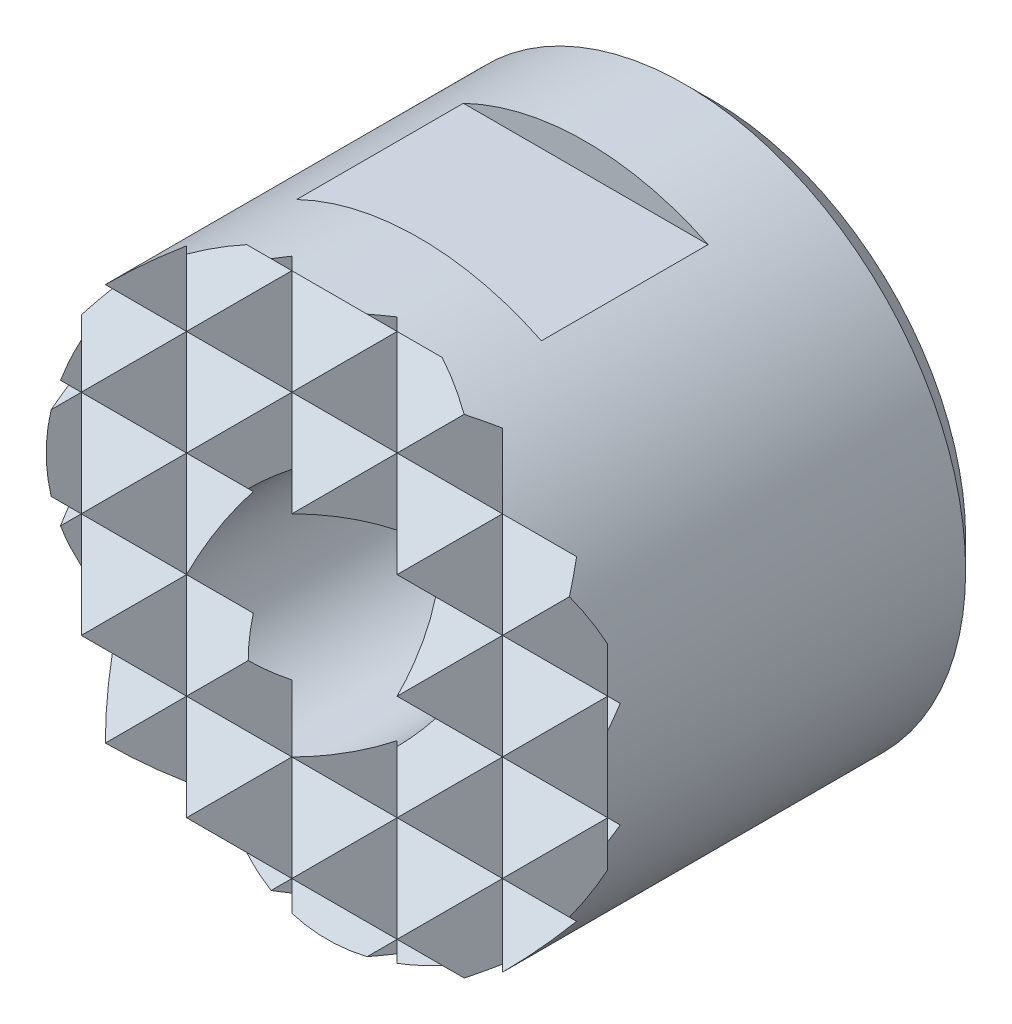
ISO-10303-21;
HEADER;
FILE_DESCRIPTION(('STEP AP214'),'2;1');
FILE_NAME('part.step','',(''),(''),'','','');
FILE_SCHEMA(('AUTOMOTIVE_DESIGN { 1 0 10303 214 1 1 1 1 }'));
ENDSEC;
DATA;
#1=APPLICATION_CONTEXT('core data for automotive mechanical design processes');
#2=APPLICATION_PROTOCOL_DEFINITION('international standard','automotive_design',2000,#1);
#3=PRODUCT_CONTEXT('',#1,'mechanical');
#4=PRODUCT('Part','Part','',(#3));
#5=PRODUCT_RELATED_PRODUCT_CATEGORY('part','',(#4));
#6=PRODUCT_DEFINITION_FORMATION('','',#4);
#7=PRODUCT_DEFINITION_CONTEXT('part definition',#1,'design');
#8=PRODUCT_DEFINITION('design','',#6,#7);
#9=PRODUCT_DEFINITION_SHAPE('','',#8);
#10=(LENGTH_UNIT() NAMED_UNIT(*) SI_UNIT(.MILLI.,.METRE.));
#11=(NAMED_UNIT(*) PLANE_ANGLE_UNIT() SI_UNIT($,.RADIAN.));
#12=(NAMED_UNIT(*) SI_UNIT($,.STERADIAN.) SOLID_ANGLE_UNIT());
#13=UNCERTAINTY_MEASURE_WITH_UNIT(LENGTH_MEASURE(1.E-05),#10,'distance_accuracy_value','');
#14=(GEOMETRIC_REPRESENTATION_CONTEXT(3) GLOBAL_UNCERTAINTY_ASSIGNED_CONTEXT((#13)) GLOBAL_UNIT_ASSIGNED_CONTEXT((#10,
#11,#12)) REPRESENTATION_CONTEXT('',''));
#15=CARTESIAN_POINT('',(0.,0.,0.));
#16=DIRECTION('',(0.,0.,1.));
#17=DIRECTION('',(1.,0.,0.));
#18=AXIS2_PLACEMENT_3D('',#15,#16,#17);
#19=CARTESIAN_POINT('',(-10.,-4.5,10.5));
#20=DIRECTION('',(0.,-0.707106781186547,-0.707106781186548));
#21=DIRECTION('',(0.,0.707106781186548,-0.707106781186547));
#22=AXIS2_PLACEMENT_3D('',#19,#20,#21);
#23=PLANE('',#22);
#24=DIRECTION('',(1.,0.,0.));
#25=VECTOR('',#24,1.);
#26=CARTESIAN_POINT('',(-10.,-4.5,10.5));
#27=LINE('',#26,#25);
#28=CARTESIAN_POINT('',(4.5,-4.5,10.5));
#29=VERTEX_POINT('',#28);
#30=CARTESIAN_POINT('',(6.61437827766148,-4.5,10.5));
#31=VERTEX_POINT('',#30);
#32=EDGE_CURVE('E676',#29,#31,#27,.T.);
#33=ORIENTED_EDGE('',*,*,#32,.F.);
#34=DIRECTION('',(0.577350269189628,-0.577350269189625,0.577350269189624));
#35=VECTOR('',#34,1.);
#36=CARTESIAN_POINT('',(-0.333333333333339,0.333333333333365,5.66666666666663));
#37=LINE('',#36,#35);
#38=CARTESIAN_POINT('',(5.65685424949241,-5.65685424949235,11.6568542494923));
#39=VERTEX_POINT('',#38);
#40=EDGE_CURVE('E489',#29,#39,#37,.T.);
#41=ORIENTED_EDGE('',*,*,#40,.T.);
#42=CARTESIAN_POINT('',(0.,0.,6.));
#43=DIRECTION('',(0.,-0.707106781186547,-0.707106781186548));
#44=DIRECTION('',(0.,0.707106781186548,-0.707106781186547));
#45=AXIS2_PLACEMENT_3D('',#42,#43,#44);
#46=ELLIPSE('',#45,11.3137084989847,8.);
#47=EDGE_CURVE('E768',#31,#39,#46,.T.);
#48=ORIENTED_EDGE('',*,*,#47,.F.);
#49=EDGE_LOOP('',(#33,#41,#48));
#50=FACE_BOUND('',#49,.T.);
#51=ADVANCED_FACE('F15',(#50),#23,.F.);
#52=CARTESIAN_POINT('',(-5.65685424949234,-5.65685424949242,11.6568542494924));
#53=VERTEX_POINT('',#52);
#54=CARTESIAN_POINT('',(-6.61437827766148,-4.5,10.5));
#55=VERTEX_POINT('',#54);
#56=EDGE_CURVE('E765',#53,#55,#46,.T.);
#57=ORIENTED_EDGE('',*,*,#56,.F.);
#58=DIRECTION('',(0.577350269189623,0.577350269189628,-0.577350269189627));
#59=VECTOR('',#58,1.);
#60=CARTESIAN_POINT('',(-6.33333333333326,-6.33333333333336,12.3333333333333));
#61=LINE('',#60,#59);
#62=CARTESIAN_POINT('',(-4.5,-4.5,10.5));
#63=VERTEX_POINT('',#62);
#64=EDGE_CURVE('E426',#53,#63,#61,.T.);
#65=ORIENTED_EDGE('',*,*,#64,.T.);
#66=EDGE_CURVE('E674',#55,#63,#27,.T.);
#67=ORIENTED_EDGE('',*,*,#66,.F.);
#68=EDGE_LOOP('',(#57,#65,#67));
#69=FACE_BOUND('',#68,.T.);
#70=ADVANCED_FACE('F948',(#69),#23,.F.);
#71=CARTESIAN_POINT('',(-10.,-6.,12.));
#72=DIRECTION('',(0.,0.707106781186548,-0.707106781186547));
#73=DIRECTION('',(0.,0.707106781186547,0.707106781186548));
#74=AXIS2_PLACEMENT_3D('',#71,#72,#73);
#75=PLANE('',#74);
#76=CARTESIAN_POINT('',(0.,0.,18.));
#77=DIRECTION('',(0.,0.707106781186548,-0.707106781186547));
#78=DIRECTION('',(0.,-0.707106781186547,-0.707106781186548));
#79=AXIS2_PLACEMENT_3D('',#76,#77,#78);
#80=ELLIPSE('',#79,11.3137084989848,8.);
#81=CARTESIAN_POINT('',(3.95435605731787,-6.95435605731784,11.0456439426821));
#82=VERTEX_POINT('',#81);
#83=CARTESIAN_POINT('',(2.783882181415,-7.5,10.5));
#84=VERTEX_POINT('',#83);
#85=EDGE_CURVE('E771',#82,#84,#80,.T.);
#86=ORIENTED_EDGE('',*,*,#85,.F.);
#87=DIRECTION('',(-0.577350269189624,0.577350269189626,0.577350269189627));
#88=VECTOR('',#87,1.);
#89=CARTESIAN_POINT('',(-1.33333333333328,-1.66666666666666,16.3333333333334));
#90=LINE('',#89,#88);
#91=CARTESIAN_POINT('',(3.00000000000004,-6.,12.));
#92=VERTEX_POINT('',#91);
#93=EDGE_CURVE('E518',#82,#92,#90,.T.);
#94=ORIENTED_EDGE('',*,*,#93,.T.);
#95=DIRECTION('',(-0.577350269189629,-0.577350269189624,-0.577350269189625));
#96=VECTOR('',#95,1.);
#97=CARTESIAN_POINT('',(-1.33333333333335,-10.3333333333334,7.66666666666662));
#98=LINE('',#97,#96);
#99=CARTESIAN_POINT('',(1.50000000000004,-7.5,10.5));
#100=VERTEX_POINT('',#99);
#101=EDGE_CURVE('E549',#92,#100,#98,.T.);
#102=ORIENTED_EDGE('',*,*,#101,.T.);
#103=DIRECTION('',(1.,0.,0.));
#104=VECTOR('',#103,1.);
#105=CARTESIAN_POINT('',(-10.,-7.5,10.5));
#106=LINE('',#105,#104);
#107=EDGE_CURVE('E679',#100,#84,#106,.T.);
#108=ORIENTED_EDGE('',*,*,#107,.T.);
#109=EDGE_LOOP('',(#86,#94,#102,#108));
#110=FACE_BOUND('',#109,.T.);
#111=ADVANCED_FACE('F955',(#110),#75,.F.);
#112=CARTESIAN_POINT('',(-1.49999999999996,-7.5,10.5));
#113=VERTEX_POINT('',#112);
#114=EDGE_CURVE('E678',#113,#100,#106,.T.);
#115=ORIENTED_EDGE('',*,*,#114,.T.);
#116=DIRECTION('',(-0.577350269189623,0.577350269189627,0.577350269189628));
#117=VECTOR('',#116,1.);
#118=CARTESIAN_POINT('',(-3.33333333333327,-2.66666666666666,15.3333333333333));
#119=LINE('',#118,#117);
#120=CARTESIAN_POINT('',(0.,-6.,12.));
#121=VERTEX_POINT('',#120);
#122=EDGE_CURVE('E575',#100,#121,#119,.T.);
#123=ORIENTED_EDGE('',*,*,#122,.T.);
#124=DIRECTION('',(-0.577350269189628,-0.577350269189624,-0.577350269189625));
#125=VECTOR('',#124,1.);
#126=CARTESIAN_POINT('',(-3.33333333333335,-9.33333333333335,8.66666666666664));
#127=LINE('',#126,#125);
#128=EDGE_CURVE('E603',#121,#113,#127,.T.);
#129=ORIENTED_EDGE('',*,*,#128,.T.);
#130=EDGE_LOOP('',(#115,#123,#129));
#131=FACE_BOUND('',#130,.T.);
#132=ADVANCED_FACE('F1192',(#131),#75,.F.);
#133=CARTESIAN_POINT('',(-10.,-7.5,10.5));
#134=DIRECTION('',(0.,-0.707106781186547,-0.707106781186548));
#135=DIRECTION('',(0.,0.707106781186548,-0.707106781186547));
#136=AXIS2_PLACEMENT_3D('',#133,#134,#135);
#137=PLANE('',#136);
#138=CARTESIAN_POINT('',(0.,0.,3.));
#139=DIRECTION('',(0.,-0.707106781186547,-0.707106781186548));
#140=DIRECTION('',(0.,0.707106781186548,-0.707106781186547));
#141=AXIS2_PLACEMENT_3D('',#138,#139,#140);
#142=ELLIPSE('',#141,11.3137084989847,8.);
#143=CARTESIAN_POINT('',(-1.79583152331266,-7.79583152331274,10.7958315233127));
#144=VERTEX_POINT('',#143);
#145=CARTESIAN_POINT('',(-2.78388218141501,-7.5,10.5));
#146=VERTEX_POINT('',#145);
#147=EDGE_CURVE('E770',#144,#146,#142,.T.);
#148=ORIENTED_EDGE('',*,*,#147,.F.);
#149=DIRECTION('',(0.577350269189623,0.577350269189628,-0.577350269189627));
#150=VECTOR('',#149,1.);
#151=CARTESIAN_POINT('',(-4.33333333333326,-10.3333333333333,13.3333333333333));
#152=LINE('',#151,#150);
#153=EDGE_CURVE('E393',#144,#113,#152,.T.);
#154=ORIENTED_EDGE('',*,*,#153,.T.);
#155=EDGE_CURVE('E391',#146,#113,#106,.T.);
#156=ORIENTED_EDGE('',*,*,#155,.F.);
#157=EDGE_LOOP('',(#148,#154,#156));
#158=FACE_BOUND('',#157,.T.);
#159=ADVANCED_FACE('F1188',(#158),#137,.F.);
#160=ORIENTED_EDGE('',*,*,#114,.F.);
#161=DIRECTION('',(0.577350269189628,-0.577350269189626,0.577350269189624));
#162=VECTOR('',#161,1.);
#163=CARTESIAN_POINT('',(-4.33333333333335,-4.66666666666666,7.66666666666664));
#164=LINE('',#163,#162);
#165=CARTESIAN_POINT('',(-1.07217269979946,-7.92782730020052,10.9278273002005));
#166=VERTEX_POINT('',#165);
#167=EDGE_CURVE('E606',#113,#166,#164,.T.);
#168=ORIENTED_EDGE('',*,*,#167,.T.);
#169=CARTESIAN_POINT('',(1.07217269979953,-7.92782730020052,10.9278273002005));
#170=VERTEX_POINT('',#169);
#171=EDGE_CURVE('E775',#170,#166,#142,.T.);
#172=ORIENTED_EDGE('',*,*,#171,.F.);
#173=DIRECTION('',(0.577350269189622,0.577350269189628,-0.577350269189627));
#174=VECTOR('',#173,1.);
#175=CARTESIAN_POINT('',(-2.33333333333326,-11.3333333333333,14.3333333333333));
#176=LINE('',#175,#174);
#177=EDGE_CURVE('E578',#170,#100,#176,.T.);
#178=ORIENTED_EDGE('',*,*,#177,.T.);
#179=EDGE_LOOP('',(#160,#168,#172,#178));
#180=FACE_BOUND('',#179,.T.);
#181=ADVANCED_FACE('F1195',(#180),#137,.F.);
#182=CARTESIAN_POINT('',(-10.,9.,12.));
#183=DIRECTION('',(0.,0.707106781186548,-0.707106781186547));
#184=DIRECTION('',(0.,0.707106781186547,0.707106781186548));
#185=AXIS2_PLACEMENT_3D('',#182,#183,#184);
#186=PLANE('',#185);
#187=DIRECTION('',(1.,0.,0.));
#188=VECTOR('',#187,1.);
#189=CARTESIAN_POINT('',(-10.,7.5,10.5));
#190=LINE('',#189,#188);
#191=CARTESIAN_POINT('',(-2.78388218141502,7.5,10.5));
#192=VERTEX_POINT('',#191);
#193=CARTESIAN_POINT('',(-1.49999999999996,7.5,10.5));
#194=VERTEX_POINT('',#193);
#195=EDGE_CURVE('E680',#192,#194,#190,.T.);
#196=ORIENTED_EDGE('',*,*,#195,.T.);
#197=DIRECTION('',(-0.577350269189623,0.577350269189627,0.577350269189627));
#198=VECTOR('',#197,1.);
#199=CARTESIAN_POINT('',(-5.33333333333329,11.3333333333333,14.3333333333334));
#200=LINE('',#199,#198);
#201=CARTESIAN_POINT('',(-1.79583152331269,7.79583152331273,10.7958315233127));
#202=VERTEX_POINT('',#201);
#203=EDGE_CURVE('E618',#194,#202,#200,.T.);
#204=ORIENTED_EDGE('',*,*,#203,.T.);
#205=CARTESIAN_POINT('',(0.,0.,3.));
#206=DIRECTION('',(0.,0.707106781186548,-0.707106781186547));
#207=DIRECTION('',(0.,-0.707106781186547,-0.707106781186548));
#208=AXIS2_PLACEMENT_3D('',#205,#206,#207);
#209=ELLIPSE('',#208,11.3137084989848,8.);
#210=EDGE_CURVE('E761',#192,#202,#209,.T.);
#211=ORIENTED_EDGE('',*,*,#210,.F.);
#212=EDGE_LOOP('',(#196,#204,#211));
#213=FACE_BOUND('',#212,.T.);
#214=ADVANCED_FACE('F1333',(#213),#186,.F.);
#215=CARTESIAN_POINT('',(-1.07217269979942,7.92782730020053,10.9278273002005));
#216=VERTEX_POINT('',#215);
#217=CARTESIAN_POINT('',(1.07217269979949,7.92782730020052,10.9278273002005));
#218=VERTEX_POINT('',#217);
#219=EDGE_CURVE('E764',#216,#218,#209,.T.);
#220=ORIENTED_EDGE('',*,*,#219,.F.);
#221=DIRECTION('',(-0.577350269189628,-0.577350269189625,-0.577350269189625));
#222=VECTOR('',#221,1.);
#223=CARTESIAN_POINT('',(-3.33333333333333,5.66666666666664,8.66666666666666));
#224=LINE('',#223,#222);
#225=EDGE_CURVE('E587',#216,#194,#224,.T.);
#226=ORIENTED_EDGE('',*,*,#225,.T.);
#227=CARTESIAN_POINT('',(1.50000000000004,7.5,10.5));
#228=VERTEX_POINT('',#227);
#229=EDGE_CURVE('E683',#194,#228,#190,.T.);
#230=ORIENTED_EDGE('',*,*,#229,.T.);
#231=DIRECTION('',(-0.577350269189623,0.577350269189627,0.577350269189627));
#232=VECTOR('',#231,1.);
#233=CARTESIAN_POINT('',(-3.33333333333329,12.3333333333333,15.3333333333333));
#234=LINE('',#233,#232);
#235=EDGE_CURVE('E561',#228,#218,#234,.T.);
#236=ORIENTED_EDGE('',*,*,#235,.T.);
#237=EDGE_LOOP('',(#220,#226,#230,#236));
#238=FACE_BOUND('',#237,.T.);
#239=ADVANCED_FACE('F1324',(#238),#186,.F.);
#240=CARTESIAN_POINT('',(-10.,7.5,10.5));
#241=DIRECTION('',(0.,-0.707106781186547,-0.707106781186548));
#242=DIRECTION('',(0.,0.707106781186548,-0.707106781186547));
#243=AXIS2_PLACEMENT_3D('',#240,#241,#242);
#244=PLANE('',#243);
#245=DIRECTION('',(0.577350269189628,-0.577350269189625,0.577350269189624));
#246=VECTOR('',#245,1.);
#247=CARTESIAN_POINT('',(-2.33333333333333,11.3333333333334,6.66666666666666));
#248=LINE('',#247,#246);
#249=CARTESIAN_POINT('',(3.00000000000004,6.,12.));
#250=VERTEX_POINT('',#249);
#251=EDGE_CURVE('E527',#228,#250,#248,.T.);
#252=ORIENTED_EDGE('',*,*,#251,.T.);
#253=DIRECTION('',(0.577350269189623,0.577350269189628,-0.577350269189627));
#254=VECTOR('',#253,1.);
#255=CARTESIAN_POINT('',(-0.333333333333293,2.66666666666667,15.3333333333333));
#256=LINE('',#255,#254);
#257=CARTESIAN_POINT('',(3.95435605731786,6.95435605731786,11.0456439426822));
#258=VERTEX_POINT('',#257);
#259=EDGE_CURVE('E498',#250,#258,#256,.T.);
#260=ORIENTED_EDGE('',*,*,#259,.T.);
#261=CARTESIAN_POINT('',(0.,0.,18.));
#262=DIRECTION('',(0.,-0.707106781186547,-0.707106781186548));
#263=DIRECTION('',(0.,0.707106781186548,-0.707106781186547));
#264=AXIS2_PLACEMENT_3D('',#261,#262,#263);
#265=ELLIPSE('',#264,11.3137084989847,8.);
#266=CARTESIAN_POINT('',(2.78388218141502,7.5,10.5));
#267=VERTEX_POINT('',#266);
#268=EDGE_CURVE('E760',#267,#258,#265,.T.);
#269=ORIENTED_EDGE('',*,*,#268,.F.);
#270=EDGE_CURVE('E684',#228,#267,#190,.T.);
#271=ORIENTED_EDGE('',*,*,#270,.F.);
#272=EDGE_LOOP('',(#252,#260,#269,#271));
#273=FACE_BOUND('',#272,.T.);
#274=ADVANCED_FACE('F1413',(#273),#244,.F.);
#275=DIRECTION('',(0.577350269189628,-0.577350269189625,0.577350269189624));
#276=VECTOR('',#275,1.);
#277=CARTESIAN_POINT('',(-4.33333333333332,10.3333333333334,7.66666666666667));
#278=LINE('',#277,#276);
#279=CARTESIAN_POINT('',(0.,6.,12.));
#280=VERTEX_POINT('',#279);
#281=EDGE_CURVE('E584',#194,#280,#278,.T.);
#282=ORIENTED_EDGE('',*,*,#281,.T.);
#283=DIRECTION('',(0.577350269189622,0.577350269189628,-0.577350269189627));
#284=VECTOR('',#283,1.);
#285=CARTESIAN_POINT('',(-2.33333333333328,3.66666666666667,14.3333333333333));
#286=LINE('',#285,#284);
#287=EDGE_CURVE('E558',#280,#228,#286,.T.);
#288=ORIENTED_EDGE('',*,*,#287,.T.);
#289=ORIENTED_EDGE('',*,*,#229,.F.);
#290=EDGE_LOOP('',(#282,#288,#289));
#291=FACE_BOUND('',#290,.T.);
#292=ADVANCED_FACE('F1321',(#291),#244,.F.);
#293=CARTESIAN_POINT('',(-10.,6.,12.));
#294=DIRECTION('',(0.,0.707106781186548,-0.707106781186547));
#295=DIRECTION('',(0.,0.707106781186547,0.707106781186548));
#296=AXIS2_PLACEMENT_3D('',#293,#294,#295);
#297=PLANE('',#296);
#298=CARTESIAN_POINT('',(0.,0.,6.));
#299=DIRECTION('',(0.,0.707106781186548,-0.707106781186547));
#300=DIRECTION('',(0.,-0.707106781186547,-0.707106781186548));
#301=AXIS2_PLACEMENT_3D('',#298,#299,#300);
#302=ELLIPSE('',#301,11.3137084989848,8.);
#303=CARTESIAN_POINT('',(5.65685424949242,5.65685424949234,11.6568542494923));
#304=VERTEX_POINT('',#303);
#305=CARTESIAN_POINT('',(6.61437827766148,4.5,10.5));
#306=VERTEX_POINT('',#305);
#307=EDGE_CURVE('E757',#304,#306,#302,.T.);
#308=ORIENTED_EDGE('',*,*,#307,.F.);
#309=DIRECTION('',(-0.577350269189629,-0.577350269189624,-0.577350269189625));
#310=VECTOR('',#309,1.);
#311=CARTESIAN_POINT('',(0.666666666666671,0.666666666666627,6.66666666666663));
#312=LINE('',#311,#310);
#313=CARTESIAN_POINT('',(4.50000000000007,4.5,10.5));
#314=VERTEX_POINT('',#313);
#315=EDGE_CURVE('E470',#304,#314,#312,.T.);
#316=ORIENTED_EDGE('',*,*,#315,.T.);
#317=DIRECTION('',(1.,0.,0.));
#318=VECTOR('',#317,1.);
#319=CARTESIAN_POINT('',(-10.,4.5,10.5));
#320=LINE('',#319,#318);
#321=EDGE_CURVE('E689',#314,#306,#320,.T.);
#322=ORIENTED_EDGE('',*,*,#321,.T.);
#323=EDGE_LOOP('',(#308,#316,#322));
#324=FACE_BOUND('',#323,.T.);
#325=ADVANCED_FACE('F980',(#324),#297,.F.);
#326=CARTESIAN_POINT('',(-6.61437827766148,4.5,10.5));
#327=VERTEX_POINT('',#326);
#328=CARTESIAN_POINT('',(-4.5,4.5,10.5));
#329=VERTEX_POINT('',#328);
#330=EDGE_CURVE('E685',#327,#329,#320,.T.);
#331=ORIENTED_EDGE('',*,*,#330,.T.);
#332=DIRECTION('',(-0.577350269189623,0.577350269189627,0.577350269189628));
#333=VECTOR('',#332,1.);
#334=CARTESIAN_POINT('',(-7.33333333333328,7.33333333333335,13.3333333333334));
#335=LINE('',#334,#333);
#336=CARTESIAN_POINT('',(-5.65685424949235,5.65685424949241,11.6568542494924));
#337=VERTEX_POINT('',#336);
#338=EDGE_CURVE('E407',#329,#337,#335,.T.);
#339=ORIENTED_EDGE('',*,*,#338,.T.);
#340=EDGE_CURVE('E753',#327,#337,#302,.T.);
#341=ORIENTED_EDGE('',*,*,#340,.F.);
#342=EDGE_LOOP('',(#331,#339,#341));
#343=FACE_BOUND('',#342,.T.);
#344=ADVANCED_FACE('F910',(#343),#297,.F.);
#345=CARTESIAN_POINT('',(-10.,3.,12.));
#346=DIRECTION('',(0.,0.707106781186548,-0.707106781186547));
#347=DIRECTION('',(0.,0.707106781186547,0.707106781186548));
#348=AXIS2_PLACEMENT_3D('',#345,#346,#347);
#349=PLANE('',#348);
#350=DIRECTION('',(1.,0.,0.));
#351=VECTOR('',#350,1.);
#352=CARTESIAN_POINT('',(-10.,1.5,10.5));
#353=LINE('',#352,#351);
#354=CARTESIAN_POINT('',(-7.85811682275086,1.5,10.5));
#355=VERTEX_POINT('',#354);
#356=CARTESIAN_POINT('',(-7.5,1.49999999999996,10.5));
#357=VERTEX_POINT('',#356);
#358=EDGE_CURVE('E666',#355,#357,#353,.T.);
#359=ORIENTED_EDGE('',*,*,#358,.T.);
#360=DIRECTION('',(-0.577350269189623,0.577350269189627,0.577350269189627));
#361=VECTOR('',#360,1.);
#362=CARTESIAN_POINT('',(-9.33333333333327,3.33333333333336,12.3333333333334));
#363=LINE('',#362,#361);
#364=CARTESIAN_POINT('',(-7.7958315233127,1.79583152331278,10.7958315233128));
#365=VERTEX_POINT('',#364);
#366=EDGE_CURVE('E643',#357,#365,#363,.T.);
#367=ORIENTED_EDGE('',*,*,#366,.T.);
#368=CARTESIAN_POINT('',(0.,0.,9.));
#369=DIRECTION('',(0.,0.707106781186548,-0.707106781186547));
#370=DIRECTION('',(0.,-0.707106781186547,-0.707106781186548));
#371=AXIS2_PLACEMENT_3D('',#368,#369,#370);
#372=ELLIPSE('',#371,11.3137084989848,8.);
#373=EDGE_CURVE('E707',#355,#365,#372,.T.);
#374=ORIENTED_EDGE('',*,*,#373,.F.);
#375=EDGE_LOOP('',(#359,#367,#374));
#376=FACE_BOUND('',#375,.T.);
#377=ADVANCED_FACE('F934',(#376),#349,.F.);
#378=DIRECTION('',(-0.577350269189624,0.577350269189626,0.577350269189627));
#379=VECTOR('',#378,1.);
#380=CARTESIAN_POINT('',(-1.33333333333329,7.33333333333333,16.3333333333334));
#381=LINE('',#380,#379);
#382=CARTESIAN_POINT('',(4.5,1.50000000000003,10.5));
#383=VERTEX_POINT('',#382);
#384=CARTESIAN_POINT('',(3.00000000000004,3.,12.));
#385=VERTEX_POINT('',#384);
#386=EDGE_CURVE('E492',#383,#385,#381,.T.);
#387=ORIENTED_EDGE('',*,*,#386,.T.);
#388=DIRECTION('',(-0.577350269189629,-0.577350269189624,-0.577350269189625));
#389=VECTOR('',#388,1.);
#390=CARTESIAN_POINT('',(-1.33333333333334,-1.33333333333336,7.66666666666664));
#391=LINE('',#390,#389);
#392=CARTESIAN_POINT('',(2.12132034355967,2.12132034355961,11.1213203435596));
#393=VERTEX_POINT('',#392);
#394=EDGE_CURVE('E521',#385,#393,#391,.T.);
#395=ORIENTED_EDGE('',*,*,#394,.T.);
#396=CARTESIAN_POINT('',(0.,0.,9.));
#397=DIRECTION('',(0.,0.707106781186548,-0.707106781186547));
#398=DIRECTION('',(0.,0.707106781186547,0.707106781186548));
#399=AXIS2_PLACEMENT_3D('',#396,#397,#398);
#400=ELLIPSE('',#399,4.24264068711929,3.);
#401=CARTESIAN_POINT('',(2.59807621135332,1.5,10.5));
#402=VERTEX_POINT('',#401);
#403=EDGE_CURVE('E752',#393,#402,#400,.T.);
#404=ORIENTED_EDGE('',*,*,#403,.T.);
#405=EDGE_CURVE('E660',#402,#383,#353,.T.);
#406=ORIENTED_EDGE('',*,*,#405,.T.);
#407=EDGE_LOOP('',(#387,#395,#404,#406));
#408=FACE_BOUND('',#407,.T.);
#409=ADVANCED_FACE('F933',(#408),#349,.F.);
#410=CARTESIAN_POINT('',(-10.,1.5,10.5));
#411=DIRECTION('',(0.,-0.707106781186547,-0.707106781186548));
#412=DIRECTION('',(0.,0.707106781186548,-0.707106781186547));
#413=AXIS2_PLACEMENT_3D('',#410,#411,#412);
#414=PLANE('',#413);
#415=CARTESIAN_POINT('',(0.,0.,12.));
#416=DIRECTION('',(0.,-0.707106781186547,-0.707106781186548));
#417=DIRECTION('',(0.,-0.707106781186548,0.707106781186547));
#418=AXIS2_PLACEMENT_3D('',#415,#416,#417);
#419=ELLIPSE('',#418,4.24264068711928,3.);
#420=CARTESIAN_POINT('',(3.00000000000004,0.,12.));
#421=VERTEX_POINT('',#420);
#422=EDGE_CURVE('E745',#402,#421,#419,.T.);
#423=ORIENTED_EDGE('',*,*,#422,.T.);
#424=DIRECTION('',(0.577350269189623,0.577350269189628,-0.577350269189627));
#425=VECTOR('',#424,1.);
#426=CARTESIAN_POINT('',(-0.333333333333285,-3.33333333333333,15.3333333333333));
#427=LINE('',#426,#425);
#428=EDGE_CURVE('E504',#421,#383,#427,.T.);
#429=ORIENTED_EDGE('',*,*,#428,.T.);
#430=ORIENTED_EDGE('',*,*,#405,.F.);
#431=EDGE_LOOP('',(#423,#429,#430));
#432=FACE_BOUND('',#431,.T.);
#433=ADVANCED_FACE('F945',(#432),#414,.F.);
#434=CARTESIAN_POINT('',(0.,0.,12.));
#435=DIRECTION('',(0.,-0.707106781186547,-0.707106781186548));
#436=DIRECTION('',(0.,0.707106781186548,-0.707106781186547));
#437=AXIS2_PLACEMENT_3D('',#434,#435,#436);
#438=ELLIPSE('',#437,11.3137084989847,8.);
#439=CARTESIAN_POINT('',(-7.92782730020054,1.07217269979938,10.9278273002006));
#440=VERTEX_POINT('',#439);
#441=EDGE_CURVE('E702',#440,#355,#438,.T.);
#442=ORIENTED_EDGE('',*,*,#441,.F.);
#443=DIRECTION('',(0.577350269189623,0.577350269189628,-0.577350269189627));
#444=VECTOR('',#443,1.);
#445=CARTESIAN_POINT('',(-8.33333333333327,0.66666666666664,11.3333333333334));
#446=LINE('',#445,#444);
#447=EDGE_CURVE('E640',#440,#357,#446,.T.);
#448=ORIENTED_EDGE('',*,*,#447,.T.);
#449=ORIENTED_EDGE('',*,*,#358,.F.);
#450=EDGE_LOOP('',(#442,#448,#449));
#451=FACE_BOUND('',#450,.T.);
#452=ADVANCED_FACE('F925',(#451),#414,.F.);
#453=CARTESIAN_POINT('',(-10.,0.,12.));
#454=DIRECTION('',(0.,0.707106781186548,-0.707106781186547));
#455=DIRECTION('',(0.,0.707106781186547,0.707106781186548));
#456=AXIS2_PLACEMENT_3D('',#453,#454,#455);
#457=PLANE('',#456);
#458=DIRECTION('',(1.,0.,0.));
#459=VECTOR('',#458,1.);
#460=CARTESIAN_POINT('',(-10.,-1.5,10.5));
#461=LINE('',#460,#459);
#462=CARTESIAN_POINT('',(-7.85811682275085,-1.5,10.5));
#463=VERTEX_POINT('',#462);
#464=CARTESIAN_POINT('',(-7.5,-1.50000000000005,10.5));
#465=VERTEX_POINT('',#464);
#466=EDGE_CURVE('E673',#463,#465,#461,.T.);
#467=ORIENTED_EDGE('',*,*,#466,.T.);
#468=DIRECTION('',(-0.577350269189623,0.577350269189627,0.577350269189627));
#469=VECTOR('',#468,1.);
#470=CARTESIAN_POINT('',(-9.33333333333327,0.333333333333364,12.3333333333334));
#471=LINE('',#470,#469);
#472=CARTESIAN_POINT('',(-7.92782730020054,-1.07217269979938,10.9278273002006));
#473=VERTEX_POINT('',#472);
#474=EDGE_CURVE('E632',#465,#473,#471,.T.);
#475=ORIENTED_EDGE('',*,*,#474,.T.);
#476=CARTESIAN_POINT('',(0.,0.,12.));
#477=DIRECTION('',(0.,0.707106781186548,-0.707106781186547));
#478=DIRECTION('',(0.,-0.707106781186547,-0.707106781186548));
#479=AXIS2_PLACEMENT_3D('',#476,#477,#478);
#480=ELLIPSE('',#479,11.3137084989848,8.);
#481=EDGE_CURVE('E701',#463,#473,#480,.T.);
#482=ORIENTED_EDGE('',*,*,#481,.F.);
#483=EDGE_LOOP('',(#467,#475,#482));
#484=FACE_BOUND('',#483,.T.);
#485=ADVANCED_FACE('F816',(#484),#457,.F.);
#486=CARTESIAN_POINT('',(2.59807621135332,-1.5,10.5));
#487=VERTEX_POINT('',#486);
#488=CARTESIAN_POINT('',(4.5,-1.49999999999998,10.5));
#489=VERTEX_POINT('',#488);
#490=EDGE_CURVE('E667',#487,#489,#461,.T.);
#491=ORIENTED_EDGE('',*,*,#490,.T.);
#492=DIRECTION('',(-0.577350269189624,0.577350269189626,0.577350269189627));
#493=VECTOR('',#492,1.);
#494=CARTESIAN_POINT('',(-1.33333333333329,4.33333333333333,16.3333333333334));
#495=LINE('',#494,#493);
#496=EDGE_CURVE('E508',#489,#421,#495,.T.);
#497=ORIENTED_EDGE('',*,*,#496,.T.);
#498=CARTESIAN_POINT('',(0.,0.,12.));
#499=DIRECTION('',(0.,0.707106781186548,-0.707106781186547));
#500=DIRECTION('',(0.,0.707106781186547,0.707106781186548));
#501=AXIS2_PLACEMENT_3D('',#498,#499,#500);
#502=ELLIPSE('',#501,4.24264068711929,3.);
#503=EDGE_CURVE('E744',#421,#487,#502,.T.);
#504=ORIENTED_EDGE('',*,*,#503,.T.);
#505=EDGE_LOOP('',(#491,#497,#504));
#506=FACE_BOUND('',#505,.T.);
#507=ADVANCED_FACE('F1491',(#506),#457,.F.);
#508=CARTESIAN_POINT('',(-10.,-1.5,10.5));
#509=DIRECTION('',(0.,-0.707106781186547,-0.707106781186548));
#510=DIRECTION('',(0.,0.707106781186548,-0.707106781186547));
#511=AXIS2_PLACEMENT_3D('',#508,#509,#510);
#512=PLANE('',#511);
#513=CARTESIAN_POINT('',(0.,0.,9.));
#514=DIRECTION('',(0.,-0.707106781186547,-0.707106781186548));
#515=DIRECTION('',(0.,-0.707106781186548,0.707106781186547));
#516=AXIS2_PLACEMENT_3D('',#513,#514,#515);
#517=ELLIPSE('',#516,4.24264068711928,3.);
#518=CARTESIAN_POINT('',(2.12132034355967,-2.12132034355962,11.1213203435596));
#519=VERTEX_POINT('',#518);
#520=EDGE_CURVE('E737',#487,#519,#517,.T.);
#521=ORIENTED_EDGE('',*,*,#520,.T.);
#522=DIRECTION('',(0.577350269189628,-0.577350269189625,0.577350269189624));
#523=VECTOR('',#522,1.);
#524=CARTESIAN_POINT('',(-2.33333333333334,2.33333333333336,6.66666666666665));
#525=LINE('',#524,#523);
#526=CARTESIAN_POINT('',(3.00000000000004,-3.,12.));
#527=VERTEX_POINT('',#526);
#528=EDGE_CURVE('E543',#519,#527,#525,.T.);
#529=ORIENTED_EDGE('',*,*,#528,.T.);
#530=DIRECTION('',(0.577350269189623,0.577350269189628,-0.577350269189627));
#531=VECTOR('',#530,1.);
#532=CARTESIAN_POINT('',(-0.333333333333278,-6.33333333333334,15.3333333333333));
#533=LINE('',#532,#531);
#534=EDGE_CURVE('E511',#527,#489,#533,.T.);
#535=ORIENTED_EDGE('',*,*,#534,.T.);
#536=ORIENTED_EDGE('',*,*,#490,.F.);
#537=EDGE_LOOP('',(#521,#529,#535,#536));
#538=FACE_BOUND('',#537,.T.);
#539=ADVANCED_FACE('F1499',(#538),#512,.F.);
#540=CARTESIAN_POINT('',(0.,0.,9.));
#541=DIRECTION('',(0.,-0.707106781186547,-0.707106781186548));
#542=DIRECTION('',(0.,0.707106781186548,-0.707106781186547));
#543=AXIS2_PLACEMENT_3D('',#540,#541,#542);
#544=ELLIPSE('',#543,11.3137084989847,8.);
#545=CARTESIAN_POINT('',(-7.7958315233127,-1.79583152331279,10.7958315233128));
#546=VERTEX_POINT('',#545);
#547=EDGE_CURVE('E696',#546,#463,#544,.T.);
#548=ORIENTED_EDGE('',*,*,#547,.F.);
#549=DIRECTION('',(0.577350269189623,0.577350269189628,-0.577350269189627));
#550=VECTOR('',#549,1.);
#551=CARTESIAN_POINT('',(-8.33333333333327,-2.33333333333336,11.3333333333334));
#552=LINE('',#551,#550);
#553=EDGE_CURVE('E23',#546,#465,#552,.T.);
#554=ORIENTED_EDGE('',*,*,#553,.T.);
#555=ORIENTED_EDGE('',*,*,#466,.F.);
#556=EDGE_LOOP('',(#548,#554,#555));
#557=FACE_BOUND('',#556,.T.);
#558=ADVANCED_FACE('F810',(#557),#512,.F.);
#559=CARTESIAN_POINT('',(-10.,-3.,12.));
#560=DIRECTION('',(0.,0.707106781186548,-0.707106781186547));
#561=DIRECTION('',(0.,0.707106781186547,0.707106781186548));
#562=AXIS2_PLACEMENT_3D('',#559,#560,#561);
#563=PLANE('',#562);
#564=CARTESIAN_POINT('',(0.,0.,15.));
#565=DIRECTION('',(0.,0.707106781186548,-0.707106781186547));
#566=DIRECTION('',(0.,-0.707106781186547,-0.707106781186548));
#567=AXIS2_PLACEMENT_3D('',#564,#565,#566);
#568=ELLIPSE('',#567,11.3137084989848,8.);
#569=CARTESIAN_POINT('',(6.95435605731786,-3.95435605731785,11.0456439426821));
#570=VERTEX_POINT('',#569);
#571=EDGE_CURVE('E693',#570,#31,#568,.T.);
#572=ORIENTED_EDGE('',*,*,#571,.F.);
#573=DIRECTION('',(-0.577350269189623,0.577350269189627,0.577350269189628));
#574=VECTOR('',#573,1.);
#575=CARTESIAN_POINT('',(0.666666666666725,2.33333333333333,17.3333333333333));
#576=LINE('',#575,#574);
#577=CARTESIAN_POINT('',(6.,-3.,12.));
#578=VERTEX_POINT('',#577);
#579=EDGE_CURVE('E464',#570,#578,#576,.T.);
#580=ORIENTED_EDGE('',*,*,#579,.T.);
#581=DIRECTION('',(-0.577350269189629,-0.577350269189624,-0.577350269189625));
#582=VECTOR('',#581,1.);
#583=CARTESIAN_POINT('',(0.666666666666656,-8.33333333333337,6.66666666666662));
#584=LINE('',#583,#582);
#585=EDGE_CURVE('E486',#578,#29,#584,.T.);
#586=ORIENTED_EDGE('',*,*,#585,.T.);
#587=ORIENTED_EDGE('',*,*,#32,.T.);
#588=EDGE_LOOP('',(#572,#580,#586,#587));
#589=FACE_BOUND('',#588,.T.);
#590=ADVANCED_FACE('F972',(#589),#563,.F.);
#591=DIRECTION('',(-0.577350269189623,0.577350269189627,0.577350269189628));
#592=VECTOR('',#591,1.);
#593=CARTESIAN_POINT('',(-7.33333333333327,-1.66666666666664,13.3333333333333));
#594=LINE('',#593,#592);
#595=CARTESIAN_POINT('',(-6.,-2.99999999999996,12.));
#596=VERTEX_POINT('',#595);
#597=EDGE_CURVE('E423',#63,#596,#594,.T.);
#598=ORIENTED_EDGE('',*,*,#597,.T.);
#599=DIRECTION('',(-0.577350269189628,-0.577350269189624,-0.577350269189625));
#600=VECTOR('',#599,1.);
#601=CARTESIAN_POINT('',(-7.33333333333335,-4.33333333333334,10.6666666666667));
#602=LINE('',#601,#600);
#603=CARTESIAN_POINT('',(-6.95435605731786,-3.95435605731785,11.0456439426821));
#604=VERTEX_POINT('',#603);
#605=EDGE_CURVE('E445',#596,#604,#602,.T.);
#606=ORIENTED_EDGE('',*,*,#605,.T.);
#607=EDGE_CURVE('E695',#55,#604,#568,.T.);
#608=ORIENTED_EDGE('',*,*,#607,.F.);
#609=ORIENTED_EDGE('',*,*,#66,.T.);
#610=EDGE_LOOP('',(#598,#606,#608,#609));
#611=FACE_BOUND('',#610,.T.);
#612=ADVANCED_FACE('F973',(#611),#563,.F.);
#613=CARTESIAN_POINT('',(-10.,4.5,10.5));
#614=DIRECTION('',(0.,-0.707106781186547,-0.707106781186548));
#615=DIRECTION('',(0.,0.707106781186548,-0.707106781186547));
#616=AXIS2_PLACEMENT_3D('',#613,#614,#615);
#617=PLANE('',#616);
#618=DIRECTION('',(0.577350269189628,-0.577350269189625,0.577350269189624));
#619=VECTOR('',#618,1.);
#620=CARTESIAN_POINT('',(-0.333333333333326,9.33333333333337,5.66666666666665));
#621=LINE('',#620,#619);
#622=CARTESIAN_POINT('',(6.,3.00000000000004,12.));
#623=VERTEX_POINT('',#622);
#624=EDGE_CURVE('E800',#314,#623,#621,.T.);
#625=ORIENTED_EDGE('',*,*,#624,.T.);
#626=DIRECTION('',(0.577350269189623,0.577350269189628,-0.577350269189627));
#627=VECTOR('',#626,1.);
#628=CARTESIAN_POINT('',(1.66666666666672,-1.33333333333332,16.3333333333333));
#629=LINE('',#628,#627);
#630=CARTESIAN_POINT('',(6.95435605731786,3.95435605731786,11.0456439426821));
#631=VERTEX_POINT('',#630);
#632=EDGE_CURVE('E803',#623,#631,#629,.T.);
#633=ORIENTED_EDGE('',*,*,#632,.T.);
#634=CARTESIAN_POINT('',(0.,0.,15.));
#635=DIRECTION('',(0.,-0.707106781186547,-0.707106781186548));
#636=DIRECTION('',(0.,0.707106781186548,-0.707106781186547));
#637=AXIS2_PLACEMENT_3D('',#634,#635,#636);
#638=ELLIPSE('',#637,11.3137084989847,8.);
#639=EDGE_CURVE('E692',#306,#631,#638,.T.);
#640=ORIENTED_EDGE('',*,*,#639,.F.);
#641=ORIENTED_EDGE('',*,*,#321,.F.);
#642=EDGE_LOOP('',(#625,#633,#640,#641));
#643=FACE_BOUND('',#642,.T.);
#644=ADVANCED_FACE('F985',(#643),#617,.F.);
#645=CARTESIAN_POINT('',(-6.95435605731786,3.95435605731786,11.0456439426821));
#646=VERTEX_POINT('',#645);
#647=EDGE_CURVE('E690',#646,#327,#638,.T.);
#648=ORIENTED_EDGE('',*,*,#647,.F.);
#649=DIRECTION('',(0.577350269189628,-0.577350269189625,0.577350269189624));
#650=VECTOR('',#649,1.);
#651=CARTESIAN_POINT('',(-8.33333333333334,5.33333333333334,9.66666666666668));
#652=LINE('',#651,#650);
#653=CARTESIAN_POINT('',(-6.,3.,12.));
#654=VERTEX_POINT('',#653);
#655=EDGE_CURVE('E782',#646,#654,#652,.T.);
#656=ORIENTED_EDGE('',*,*,#655,.T.);
#657=DIRECTION('',(0.577350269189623,0.577350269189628,-0.577350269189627));
#658=VECTOR('',#657,1.);
#659=CARTESIAN_POINT('',(-6.33333333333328,2.66666666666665,12.3333333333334));
#660=LINE('',#659,#658);
#661=EDGE_CURVE('E779',#654,#329,#660,.T.);
#662=ORIENTED_EDGE('',*,*,#661,.T.);
#663=ORIENTED_EDGE('',*,*,#330,.F.);
#664=EDGE_LOOP('',(#648,#656,#662,#663));
#665=FACE_BOUND('',#664,.T.);
#666=ADVANCED_FACE('F913',(#665),#617,.F.);
#667=CARTESIAN_POINT('',(0.,0.,12.));
#668=DIRECTION('',(0.,0.,-1.));
#669=DIRECTION('',(-1.,0.,0.));
#670=AXIS2_PLACEMENT_3D('',#667,#668,#669);
#671=CYLINDRICAL_SURFACE('',#670,8.);
#672=CARTESIAN_POINT('',(0.,0.,8.375));
#673=DIRECTION('',(0.,0.,1.));
#674=DIRECTION('',(1.,0.,0.));
#675=AXIS2_PLACEMENT_3D('',#672,#673,#674);
#676=CIRCLE('',#675,8.);
#677=CARTESIAN_POINT('',(3.48711915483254,7.2,8.375));
#678=VERTEX_POINT('',#677);
#679=CARTESIAN_POINT('',(-3.48711915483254,7.2,8.375));
#680=VERTEX_POINT('',#679);
#681=EDGE_CURVE('E731',#678,#680,#676,.T.);
#682=ORIENTED_EDGE('',*,*,#681,.T.);
#683=DIRECTION('',(0.,0.,-1.));
#684=VECTOR('',#683,1.);
#685=CARTESIAN_POINT('',(-3.48711915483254,7.2,12.));
#686=LINE('',#685,#684);
#687=CARTESIAN_POINT('',(-3.48711915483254,7.2,3.625));
#688=VERTEX_POINT('',#687);
#689=EDGE_CURVE('E734',#680,#688,#686,.T.);
#690=ORIENTED_EDGE('',*,*,#689,.T.);
#691=CARTESIAN_POINT('',(0.,0.,3.625));
#692=DIRECTION('',(0.,0.,-1.));
#693=DIRECTION('',(-1.,0.,0.));
#694=AXIS2_PLACEMENT_3D('',#691,#692,#693);
#695=CIRCLE('',#694,8.);
#696=CARTESIAN_POINT('',(3.48711915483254,7.2,3.625));
#697=VERTEX_POINT('',#696);
#698=EDGE_CURVE('E728',#688,#697,#695,.T.);
#699=ORIENTED_EDGE('',*,*,#698,.T.);
#700=DIRECTION('',(0.,0.,-1.));
#701=VECTOR('',#700,1.);
#702=CARTESIAN_POINT('',(3.48711915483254,7.2,12.));
#703=LINE('',#702,#701);
#704=EDGE_CURVE('E725',#697,#678,#703,.F.);
#705=ORIENTED_EDGE('',*,*,#704,.T.);
#706=EDGE_LOOP('',(#682,#690,#699,#705));
#707=FACE_BOUND('',#706,.T.);
#708=CARTESIAN_POINT('',(0.,0.,0.8));
#709=DIRECTION('',(0.,0.,1.));
#710=DIRECTION('',(1.,0.,0.));
#711=AXIS2_PLACEMENT_3D('',#708,#709,#710);
#712=CIRCLE('',#711,8.);
#713=CARTESIAN_POINT('',(8.,0.,0.8));
#714=VERTEX_POINT('',#713);
#715=EDGE_CURVE('E719',#714,#714,#712,.T.);
#716=ORIENTED_EDGE('',*,*,#715,.T.);
#717=EDGE_LOOP('',(#716));
#718=FACE_BOUND('',#717,.T.);
#719=ORIENTED_EDGE('',*,*,#210,.T.);
#720=CARTESIAN_POINT('',(0.,0.,9.));
#721=DIRECTION('',(-0.70710678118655,0.,-0.707106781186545));
#722=DIRECTION('',(0.707106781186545,0.,-0.70710678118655));
#723=AXIS2_PLACEMENT_3D('',#720,#721,#722);
#724=ELLIPSE('',#723,11.3137084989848,8.);
#725=CARTESIAN_POINT('',(-1.49999999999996,7.85811682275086,10.5));
#726=VERTEX_POINT('',#725);
#727=EDGE_CURVE('E623',#202,#726,#724,.T.);
#728=ORIENTED_EDGE('',*,*,#727,.T.);
#729=CARTESIAN_POINT('',(0.,0.,12.));
#730=DIRECTION('',(0.707106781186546,0.,-0.70710678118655));
#731=DIRECTION('',(-0.70710678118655,0.,-0.707106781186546));
#732=AXIS2_PLACEMENT_3D('',#729,#730,#731);
#733=ELLIPSE('',#732,11.3137084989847,8.);
#734=EDGE_CURVE('E592',#726,#216,#733,.T.);
#735=ORIENTED_EDGE('',*,*,#734,.T.);
#736=ORIENTED_EDGE('',*,*,#219,.T.);
#737=CARTESIAN_POINT('',(0.,0.,12.));
#738=DIRECTION('',(-0.70710678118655,0.,-0.707106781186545));
#739=DIRECTION('',(0.707106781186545,0.,-0.70710678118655));
#740=AXIS2_PLACEMENT_3D('',#737,#738,#739);
#741=ELLIPSE('',#740,11.3137084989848,8.);
#742=CARTESIAN_POINT('',(1.50000000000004,7.85811682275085,10.5));
#743=VERTEX_POINT('',#742);
#744=EDGE_CURVE('E566',#218,#743,#741,.T.);
#745=ORIENTED_EDGE('',*,*,#744,.T.);
#746=CARTESIAN_POINT('',(0.,0.,9.));
#747=DIRECTION('',(0.707106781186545,0.,-0.70710678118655));
#748=DIRECTION('',(-0.70710678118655,0.,-0.707106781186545));
#749=AXIS2_PLACEMENT_3D('',#746,#747,#748);
#750=ELLIPSE('',#749,11.3137084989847,8.);
#751=CARTESIAN_POINT('',(1.79583152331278,7.79583152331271,10.7958315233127));
#752=VERTEX_POINT('',#751);
#753=EDGE_CURVE('E535',#743,#752,#750,.T.);
#754=ORIENTED_EDGE('',*,*,#753,.T.);
#755=EDGE_CURVE('E759',#752,#267,#209,.T.);
#756=ORIENTED_EDGE('',*,*,#755,.T.);
#757=ORIENTED_EDGE('',*,*,#268,.T.);
#758=CARTESIAN_POINT('',(0.,0.,15.));
#759=DIRECTION('',(-0.70710678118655,0.,-0.707106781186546));
#760=DIRECTION('',(0.707106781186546,0.,-0.70710678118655));
#761=AXIS2_PLACEMENT_3D('',#758,#759,#760);
#762=ELLIPSE('',#761,11.3137084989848,8.);
#763=CARTESIAN_POINT('',(4.5,6.61437827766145,10.5));
#764=VERTEX_POINT('',#763);
#765=EDGE_CURVE('E501',#258,#764,#762,.T.);
#766=ORIENTED_EDGE('',*,*,#765,.T.);
#767=CARTESIAN_POINT('',(0.,0.,6.));
#768=DIRECTION('',(0.707106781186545,0.,-0.70710678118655));
#769=DIRECTION('',(-0.70710678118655,0.,-0.707106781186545));
#770=AXIS2_PLACEMENT_3D('',#767,#768,#769);
#771=ELLIPSE('',#770,11.3137084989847,8.);
#772=EDGE_CURVE('E473',#764,#304,#771,.T.);
#773=ORIENTED_EDGE('',*,*,#772,.T.);
#774=ORIENTED_EDGE('',*,*,#307,.T.);
#775=ORIENTED_EDGE('',*,*,#639,.T.);
#776=CARTESIAN_POINT('',(0.,0.,18.));
#777=DIRECTION('',(-0.70710678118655,0.,-0.707106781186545));
#778=DIRECTION('',(0.707106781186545,0.,-0.70710678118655));
#779=AXIS2_PLACEMENT_3D('',#776,#777,#778);
#780=ELLIPSE('',#779,11.3137084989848,8.);
#781=CARTESIAN_POINT('',(7.5,2.78388218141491,10.5));
#782=VERTEX_POINT('',#781);
#783=EDGE_CURVE('E451',#631,#782,#780,.T.);
#784=ORIENTED_EDGE('',*,*,#783,.T.);
#785=CARTESIAN_POINT('',(0.,0.,2.99999999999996));
#786=DIRECTION('',(0.707106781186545,0.,-0.70710678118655));
#787=DIRECTION('',(-0.70710678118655,0.,-0.707106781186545));
#788=AXIS2_PLACEMENT_3D('',#785,#786,#787);
#789=ELLIPSE('',#788,11.3137084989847,8.);
#790=CARTESIAN_POINT('',(7.79583152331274,1.79583152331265,10.7958315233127));
#791=VERTEX_POINT('',#790);
#792=EDGE_CURVE('E653',#782,#791,#789,.T.);
#793=ORIENTED_EDGE('',*,*,#792,.T.);
#794=CARTESIAN_POINT('',(7.85811682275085,1.5,10.5));
#795=VERTEX_POINT('',#794);
#796=EDGE_CURVE('E705',#791,#795,#372,.T.);
#797=ORIENTED_EDGE('',*,*,#796,.T.);
#798=CARTESIAN_POINT('',(7.92782730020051,1.07217269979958,10.9278273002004));
#799=VERTEX_POINT('',#798);
#800=EDGE_CURVE('E704',#795,#799,#438,.T.);
#801=ORIENTED_EDGE('',*,*,#800,.T.);
#802=CARTESIAN_POINT('',(7.92782730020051,-1.07217269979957,10.9278273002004));
#803=VERTEX_POINT('',#802);
#804=EDGE_CURVE('E652',#799,#803,#789,.T.);
#805=ORIENTED_EDGE('',*,*,#804,.T.);
#806=CARTESIAN_POINT('',(7.85811682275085,-1.5,10.5));
#807=VERTEX_POINT('',#806);
#808=EDGE_CURVE('E699',#803,#807,#480,.T.);
#809=ORIENTED_EDGE('',*,*,#808,.T.);
#810=CARTESIAN_POINT('',(7.79583152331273,-1.79583152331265,10.7958315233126));
#811=VERTEX_POINT('',#810);
#812=EDGE_CURVE('E698',#807,#811,#544,.T.);
#813=ORIENTED_EDGE('',*,*,#812,.T.);
#814=CARTESIAN_POINT('',(7.5,-2.78388218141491,10.5));
#815=VERTEX_POINT('',#814);
#816=EDGE_CURVE('E649',#811,#815,#789,.T.);
#817=ORIENTED_EDGE('',*,*,#816,.T.);
#818=EDGE_CURVE('E455',#815,#570,#780,.T.);
#819=ORIENTED_EDGE('',*,*,#818,.T.);
#820=ORIENTED_EDGE('',*,*,#571,.T.);
#821=ORIENTED_EDGE('',*,*,#47,.T.);
#822=CARTESIAN_POINT('',(4.5,-6.61437827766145,10.5));
#823=VERTEX_POINT('',#822);
#824=EDGE_CURVE('E477',#39,#823,#771,.T.);
#825=ORIENTED_EDGE('',*,*,#824,.T.);
#826=EDGE_CURVE('E505',#823,#82,#762,.T.);
#827=ORIENTED_EDGE('',*,*,#826,.T.);
#828=ORIENTED_EDGE('',*,*,#85,.T.);
#829=CARTESIAN_POINT('',(1.79583152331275,-7.79583152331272,10.7958315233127));
#830=VERTEX_POINT('',#829);
#831=EDGE_CURVE('E772',#84,#830,#142,.T.);
#832=ORIENTED_EDGE('',*,*,#831,.T.);
#833=CARTESIAN_POINT('',(1.50000000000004,-7.85811682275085,10.5));
#834=VERTEX_POINT('',#833);
#835=EDGE_CURVE('E540',#830,#834,#750,.T.);
#836=ORIENTED_EDGE('',*,*,#835,.T.);
#837=EDGE_CURVE('E571',#834,#170,#741,.T.);
#838=ORIENTED_EDGE('',*,*,#837,.T.);
#839=ORIENTED_EDGE('',*,*,#171,.T.);
#840=CARTESIAN_POINT('',(-1.49999999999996,-7.85811682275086,10.5));
#841=VERTEX_POINT('',#840);
#842=EDGE_CURVE('E597',#166,#841,#733,.T.);
#843=ORIENTED_EDGE('',*,*,#842,.T.);
#844=EDGE_CURVE('E627',#841,#144,#724,.T.);
#845=ORIENTED_EDGE('',*,*,#844,.T.);
#846=ORIENTED_EDGE('',*,*,#147,.T.);
#847=CARTESIAN_POINT('',(-3.95435605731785,-6.95435605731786,11.0456439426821));
#848=VERTEX_POINT('',#847);
#849=EDGE_CURVE('E767',#146,#848,#80,.T.);
#850=ORIENTED_EDGE('',*,*,#849,.T.);
#851=CARTESIAN_POINT('',(0.,0.,15.));
#852=DIRECTION('',(0.707106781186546,0.,-0.70710678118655));
#853=DIRECTION('',(-0.70710678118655,0.,-0.707106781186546));
#854=AXIS2_PLACEMENT_3D('',#851,#852,#853);
#855=ELLIPSE('',#854,11.3137084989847,8.);
#856=CARTESIAN_POINT('',(-4.5,-6.6143782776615,10.5));
#857=VERTEX_POINT('',#856);
#858=EDGE_CURVE('E383',#848,#857,#855,.T.);
#859=ORIENTED_EDGE('',*,*,#858,.T.);
#860=CARTESIAN_POINT('',(0.,0.,6.));
#861=DIRECTION('',(-0.70710678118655,0.,-0.707106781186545));
#862=DIRECTION('',(0.707106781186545,0.,-0.70710678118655));
#863=AXIS2_PLACEMENT_3D('',#860,#861,#862);
#864=ELLIPSE('',#863,11.3137084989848,8.);
#865=EDGE_CURVE('E414',#857,#53,#864,.T.);
#866=ORIENTED_EDGE('',*,*,#865,.T.);
#867=ORIENTED_EDGE('',*,*,#56,.T.);
#868=ORIENTED_EDGE('',*,*,#607,.T.);
#869=CARTESIAN_POINT('',(0.,0.,18.));
#870=DIRECTION('',(0.707106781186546,0.,-0.70710678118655));
#871=DIRECTION('',(-0.70710678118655,0.,-0.707106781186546));
#872=AXIS2_PLACEMENT_3D('',#869,#870,#871);
#873=ELLIPSE('',#872,11.3137084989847,8.);
#874=CARTESIAN_POINT('',(-7.5,-2.78388218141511,10.5));
#875=VERTEX_POINT('',#874);
#876=EDGE_CURVE('E436',#604,#875,#873,.T.);
#877=ORIENTED_EDGE('',*,*,#876,.T.);
#878=CARTESIAN_POINT('',(0.,0.,3.));
#879=DIRECTION('',(-0.70710678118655,0.,-0.707106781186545));
#880=DIRECTION('',(0.707106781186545,0.,-0.70710678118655));
#881=AXIS2_PLACEMENT_3D('',#878,#879,#880);
#882=ELLIPSE('',#881,11.3137084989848,8.);
#883=EDGE_CURVE('E638',#875,#546,#882,.T.);
#884=ORIENTED_EDGE('',*,*,#883,.T.);
#885=ORIENTED_EDGE('',*,*,#547,.T.);
#886=ORIENTED_EDGE('',*,*,#481,.T.);
#887=EDGE_CURVE('E635',#473,#440,#882,.T.);
#888=ORIENTED_EDGE('',*,*,#887,.T.);
#889=ORIENTED_EDGE('',*,*,#441,.T.);
#890=ORIENTED_EDGE('',*,*,#373,.T.);
#891=CARTESIAN_POINT('',(-7.5,2.78388218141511,10.5));
#892=VERTEX_POINT('',#891);
#893=EDGE_CURVE('E639',#365,#892,#882,.T.);
#894=ORIENTED_EDGE('',*,*,#893,.T.);
#895=EDGE_CURVE('E432',#892,#646,#873,.T.);
#896=ORIENTED_EDGE('',*,*,#895,.T.);
#897=ORIENTED_EDGE('',*,*,#647,.T.);
#898=ORIENTED_EDGE('',*,*,#340,.T.);
#899=CARTESIAN_POINT('',(-4.5,6.6143782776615,10.5));
#900=VERTEX_POINT('',#899);
#901=EDGE_CURVE('E410',#337,#900,#864,.T.);
#902=ORIENTED_EDGE('',*,*,#901,.T.);
#903=CARTESIAN_POINT('',(-3.95435605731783,6.95435605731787,11.0456439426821));
#904=VERTEX_POINT('',#903);
#905=EDGE_CURVE('E858',#900,#904,#855,.T.);
#906=ORIENTED_EDGE('',*,*,#905,.T.);
#907=EDGE_CURVE('E756',#904,#192,#265,.T.);
#908=ORIENTED_EDGE('',*,*,#907,.T.);
#909=EDGE_LOOP('',(#719,#728,#735,#736,#745,#754,#756,#757,#766,#773,#774,#775,#784,#793,#797,
#801,#805,#809,#813,#817,#819,#820,#821,#825,#827,#828,#832,#836,#838,#839,#843,#845,#846,#850,
#859,#866,#867,#868,#877,#884,#885,#886,#888,#889,#890,#894,#896,#897,#898,#902,#906,#908));
#910=FACE_BOUND('',#909,.T.);
#911=ADVANCED_FACE('F1106',(#707,#718,#910),#671,.T.);
#912=CARTESIAN_POINT('',(0.,0.,0.));
#913=DIRECTION('',(0.,0.,1.));
#914=DIRECTION('',(1.,0.,0.));
#915=AXIS2_PLACEMENT_3D('',#912,#913,#914);
#916=PLANE('',#915);
#917=CARTESIAN_POINT('',(0.,0.,0.));
#918=DIRECTION('',(0.,0.,1.));
#919=DIRECTION('',(1.,0.,0.));
#920=AXIS2_PLACEMENT_3D('',#917,#918,#919);
#921=CIRCLE('',#920,7.2);
#922=CARTESIAN_POINT('',(7.2,0.,0.));
#923=VERTEX_POINT('',#922);
#924=EDGE_CURVE('E722',#923,#923,#921,.F.);
#925=ORIENTED_EDGE('',*,*,#924,.T.);
#926=EDGE_LOOP('',(#925));
#927=FACE_BOUND('',#926,.T.);
#928=CARTESIAN_POINT('',(0.,0.,0.));
#929=DIRECTION('',(0.,0.,1.));
#930=DIRECTION('',(1.,0.,0.));
#931=AXIS2_PLACEMENT_3D('',#928,#929,#930);
#932=CIRCLE('',#931,3.45);
#933=CARTESIAN_POINT('',(3.45,0.,0.));
#934=VERTEX_POINT('',#933);
#935=EDGE_CURVE('E711',#934,#934,#932,.T.);
#936=ORIENTED_EDGE('',*,*,#935,.T.);
#937=EDGE_LOOP('',(#936));
#938=FACE_BOUND('',#937,.T.);
#939=ADVANCED_FACE('F1549',(#927,#938),#916,.F.);
#940=CARTESIAN_POINT('',(0.,0.,12.));
#941=DIRECTION('',(0.,0.,1.));
#942=DIRECTION('',(1.,0.,0.));
#943=AXIS2_PLACEMENT_3D('',#940,#941,#942);
#944=CYLINDRICAL_SURFACE('',#943,3.);
#945=CARTESIAN_POINT('',(0.,0.,9.));
#946=DIRECTION('',(-0.70710678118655,0.,-0.707106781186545));
#947=DIRECTION('',(-0.707106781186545,0.,0.70710678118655));
#948=AXIS2_PLACEMENT_3D('',#945,#946,#947);
#949=ELLIPSE('',#948,4.2426406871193,3.);
#950=CARTESIAN_POINT('',(-1.49999999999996,-2.59807621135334,10.5));
#951=VERTEX_POINT('',#950);
#952=CARTESIAN_POINT('',(-2.12132034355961,-2.12132034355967,11.1213203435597));
#953=VERTEX_POINT('',#952);
#954=EDGE_CURVE('E371',#951,#953,#949,.T.);
#955=ORIENTED_EDGE('',*,*,#954,.F.);
#956=CARTESIAN_POINT('',(0.,0.,12.));
#957=DIRECTION('',(0.707106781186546,0.,-0.70710678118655));
#958=DIRECTION('',(0.70710678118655,0.,0.707106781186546));
#959=AXIS2_PLACEMENT_3D('',#956,#957,#958);
#960=ELLIPSE('',#959,4.24264068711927,3.);
#961=CARTESIAN_POINT('',(0.,-3.,12.));
#962=VERTEX_POINT('',#961);
#963=EDGE_CURVE('E593',#962,#951,#960,.T.);
#964=ORIENTED_EDGE('',*,*,#963,.F.);
#965=CARTESIAN_POINT('',(0.,0.,12.));
#966=DIRECTION('',(-0.70710678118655,0.,-0.707106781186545));
#967=DIRECTION('',(-0.707106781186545,0.,0.70710678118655));
#968=AXIS2_PLACEMENT_3D('',#965,#966,#967);
#969=ELLIPSE('',#968,4.2426406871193,3.);
#970=CARTESIAN_POINT('',(1.50000000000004,-2.5980762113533,10.5));
#971=VERTEX_POINT('',#970);
#972=EDGE_CURVE('E567',#971,#962,#969,.T.);
#973=ORIENTED_EDGE('',*,*,#972,.F.);
#974=CARTESIAN_POINT('',(0.,0.,9.));
#975=DIRECTION('',(0.707106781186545,0.,-0.70710678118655));
#976=DIRECTION('',(0.70710678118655,0.,0.707106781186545));
#977=AXIS2_PLACEMENT_3D('',#974,#975,#976);
#978=ELLIPSE('',#977,4.24264068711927,3.);
#979=EDGE_CURVE('E536',#519,#971,#978,.T.);
#980=ORIENTED_EDGE('',*,*,#979,.F.);
#981=ORIENTED_EDGE('',*,*,#520,.F.);
#982=ORIENTED_EDGE('',*,*,#503,.F.);
#983=ORIENTED_EDGE('',*,*,#422,.F.);
#984=ORIENTED_EDGE('',*,*,#403,.F.);
#985=CARTESIAN_POINT('',(1.50000000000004,2.59807621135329,10.5));
#986=VERTEX_POINT('',#985);
#987=EDGE_CURVE('E533',#986,#393,#978,.T.);
#988=ORIENTED_EDGE('',*,*,#987,.F.);
#989=CARTESIAN_POINT('',(0.,3.,12.));
#990=VERTEX_POINT('',#989);
#991=EDGE_CURVE('E564',#990,#986,#969,.T.);
#992=ORIENTED_EDGE('',*,*,#991,.F.);
#993=CARTESIAN_POINT('',(-1.49999999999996,2.59807621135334,10.5));
#994=VERTEX_POINT('',#993);
#995=EDGE_CURVE('E590',#994,#990,#960,.T.);
#996=ORIENTED_EDGE('',*,*,#995,.F.);
#997=CARTESIAN_POINT('',(-2.12132034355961,2.12132034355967,11.1213203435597));
#998=VERTEX_POINT('',#997);
#999=EDGE_CURVE('E621',#998,#994,#949,.T.);
#1000=ORIENTED_EDGE('',*,*,#999,.F.);
#1001=CARTESIAN_POINT('',(-2.59807621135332,1.5,10.5));
#1002=VERTEX_POINT('',#1001);
#1003=EDGE_CURVE('E749',#1002,#998,#400,.T.);
#1004=ORIENTED_EDGE('',*,*,#1003,.F.);
#1005=CARTESIAN_POINT('',(-2.99999999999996,0.,12.));
#1006=VERTEX_POINT('',#1005);
#1007=EDGE_CURVE('E748',#1006,#1002,#419,.T.);
#1008=ORIENTED_EDGE('',*,*,#1007,.F.);
#1009=CARTESIAN_POINT('',(-2.59807621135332,-1.5,10.5));
#1010=VERTEX_POINT('',#1009);
#1011=EDGE_CURVE('E741',#1010,#1006,#502,.T.);
#1012=ORIENTED_EDGE('',*,*,#1011,.F.);
#1013=EDGE_CURVE('E740',#953,#1010,#517,.T.);
#1014=ORIENTED_EDGE('',*,*,#1013,.F.);
#1015=EDGE_LOOP('',(#955,#964,#973,#980,#981,#982,#983,#984,#988,#992,#996,#1000,#1004,#1008,
#1012,#1014));
#1016=FACE_BOUND('',#1015,.T.);
#1017=CARTESIAN_POINT('',(0.,0.,0.45));
#1018=DIRECTION('',(0.,0.,1.));
#1019=DIRECTION('',(1.,0.,0.));
#1020=AXIS2_PLACEMENT_3D('',#1017,#1018,#1019);
#1021=CIRCLE('',#1020,3.);
#1022=CARTESIAN_POINT('',(3.,0.,0.45));
#1023=VERTEX_POINT('',#1022);
#1024=EDGE_CURVE('E716',#1023,#1023,#1021,.F.);
#1025=ORIENTED_EDGE('',*,*,#1024,.T.);
#1026=EDGE_LOOP('',(#1025));
#1027=FACE_BOUND('',#1026,.T.);
#1028=ADVANCED_FACE('F1277',(#1016,#1027),#944,.F.);
#1029=CARTESIAN_POINT('',(0.,0.,0.));
#1030=DIRECTION('',(0.,0.,-1.));
#1031=DIRECTION('',(-1.,0.,0.));
#1032=AXIS2_PLACEMENT_3D('',#1029,#1030,#1031);
#1033=CONICAL_SURFACE('',#1032,3.45,0.785398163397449);
#1034=ORIENTED_EDGE('',*,*,#1024,.F.);
#1035=EDGE_LOOP('',(#1034));
#1036=FACE_BOUND('',#1035,.T.);
#1037=ORIENTED_EDGE('',*,*,#935,.F.);
#1038=EDGE_LOOP('',(#1037));
#1039=FACE_BOUND('',#1038,.T.);
#1040=ADVANCED_FACE('F1568',(#1036,#1039),#1033,.F.);
#1041=CARTESIAN_POINT('',(0.,0.,0.8));
#1042=DIRECTION('',(0.,0.,1.));
#1043=DIRECTION('',(1.,0.,0.));
#1044=AXIS2_PLACEMENT_3D('',#1041,#1042,#1043);
#1045=CONICAL_SURFACE('',#1044,8.,0.78539816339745);
#1046=ORIENTED_EDGE('',*,*,#924,.F.);
#1047=EDGE_LOOP('',(#1046));
#1048=FACE_BOUND('',#1047,.T.);
#1049=ORIENTED_EDGE('',*,*,#715,.F.);
#1050=EDGE_LOOP('',(#1049));
#1051=FACE_BOUND('',#1050,.T.);
#1052=ADVANCED_FACE('F17',(#1048,#1051),#1045,.T.);
#1053=CARTESIAN_POINT('',(-5.,8.95992731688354,8.375));
#1054=DIRECTION('',(0.,0.,1.));
#1055=DIRECTION('',(1.,0.,0.));
#1056=AXIS2_PLACEMENT_3D('',#1053,#1054,#1055);
#1057=PLANE('',#1056);
#1058=DIRECTION('',(1.,0.,0.));
#1059=VECTOR('',#1058,1.);
#1060=CARTESIAN_POINT('',(-5.,7.2,8.375));
#1061=LINE('',#1060,#1059);
#1062=EDGE_CURVE('E712',#680,#678,#1061,.T.);
#1063=ORIENTED_EDGE('',*,*,#1062,.F.);
#1064=ORIENTED_EDGE('',*,*,#681,.F.);
#1065=EDGE_LOOP('',(#1063,#1064));
#1066=FACE_BOUND('',#1065,.T.);
#1067=ADVANCED_FACE('F1585',(#1066),#1057,.F.);
#1068=CARTESIAN_POINT('',(-5.,8.95992731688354,3.625));
#1069=DIRECTION('',(0.,0.,-1.));
#1070=DIRECTION('',(-1.,0.,0.));
#1071=AXIS2_PLACEMENT_3D('',#1068,#1069,#1070);
#1072=PLANE('',#1071);
#1073=DIRECTION('',(1.,0.,0.));
#1074=VECTOR('',#1073,1.);
#1075=CARTESIAN_POINT('',(-5.,7.2,3.625));
#1076=LINE('',#1075,#1074);
#1077=EDGE_CURVE('E708',#688,#697,#1076,.T.);
#1078=ORIENTED_EDGE('',*,*,#1077,.T.);
#1079=ORIENTED_EDGE('',*,*,#698,.F.);
#1080=EDGE_LOOP('',(#1078,#1079));
#1081=FACE_BOUND('',#1080,.T.);
#1082=ADVANCED_FACE('F1594',(#1081),#1072,.F.);
#1083=CARTESIAN_POINT('',(-5.,7.2,8.375));
#1084=DIRECTION('',(0.,-1.,0.));
#1085=DIRECTION('',(0.,0.,-1.));
#1086=AXIS2_PLACEMENT_3D('',#1083,#1084,#1085);
#1087=PLANE('',#1086);
#1088=ORIENTED_EDGE('',*,*,#1062,.T.);
#1089=ORIENTED_EDGE('',*,*,#704,.F.);
#1090=ORIENTED_EDGE('',*,*,#1077,.F.);
#1091=ORIENTED_EDGE('',*,*,#689,.F.);
#1092=EDGE_LOOP('',(#1088,#1089,#1090,#1091));
#1093=FACE_BOUND('',#1092,.T.);
#1094=ADVANCED_FACE('F1604',(#1093),#1087,.F.);
#1095=ORIENTED_EDGE('',*,*,#155,.T.);
#1096=DIRECTION('',(-0.577350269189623,0.577350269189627,0.577350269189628));
#1097=VECTOR('',#1096,1.);
#1098=CARTESIAN_POINT('',(-5.33333333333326,-3.66666666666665,14.3333333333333));
#1099=LINE('',#1098,#1097);
#1100=CARTESIAN_POINT('',(-2.99999999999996,-6.,12.));
#1101=VERTEX_POINT('',#1100);
#1102=EDGE_CURVE('E363',#113,#1101,#1099,.T.);
#1103=ORIENTED_EDGE('',*,*,#1102,.T.);
#1104=DIRECTION('',(-0.577350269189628,-0.577350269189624,-0.577350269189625));
#1105=VECTOR('',#1104,1.);
#1106=CARTESIAN_POINT('',(-5.33333333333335,-8.33333333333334,9.66666666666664));
#1107=LINE('',#1106,#1105);
#1108=EDGE_CURVE('E377',#1101,#848,#1107,.T.);
#1109=ORIENTED_EDGE('',*,*,#1108,.T.);
#1110=ORIENTED_EDGE('',*,*,#849,.F.);
#1111=EDGE_LOOP('',(#1095,#1103,#1109,#1110));
#1112=FACE_BOUND('',#1111,.T.);
#1113=ADVANCED_FACE('F389',(#1112),#75,.F.);
#1114=ORIENTED_EDGE('',*,*,#107,.F.);
#1115=DIRECTION('',(0.577350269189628,-0.577350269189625,0.577350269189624));
#1116=VECTOR('',#1115,1.);
#1117=CARTESIAN_POINT('',(-2.33333333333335,-3.66666666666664,6.66666666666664));
#1118=LINE('',#1117,#1116);
#1119=EDGE_CURVE('E552',#100,#830,#1118,.T.);
#1120=ORIENTED_EDGE('',*,*,#1119,.T.);
#1121=ORIENTED_EDGE('',*,*,#831,.F.);
#1122=EDGE_LOOP('',(#1114,#1120,#1121));
#1123=FACE_BOUND('',#1122,.T.);
#1124=ADVANCED_FACE('F1205',(#1123),#137,.F.);
#1125=ORIENTED_EDGE('',*,*,#755,.F.);
#1126=DIRECTION('',(-0.577350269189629,-0.577350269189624,-0.577350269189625));
#1127=VECTOR('',#1126,1.);
#1128=CARTESIAN_POINT('',(-1.33333333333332,4.66666666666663,7.66666666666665));
#1129=LINE('',#1128,#1127);
#1130=EDGE_CURVE('E530',#752,#228,#1129,.T.);
#1131=ORIENTED_EDGE('',*,*,#1130,.T.);
#1132=ORIENTED_EDGE('',*,*,#270,.T.);
#1133=EDGE_LOOP('',(#1125,#1131,#1132));
#1134=FACE_BOUND('',#1133,.T.);
#1135=ADVANCED_FACE('F1425',(#1134),#186,.F.);
#1136=DIRECTION('',(0.577350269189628,-0.577350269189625,0.577350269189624));
#1137=VECTOR('',#1136,1.);
#1138=CARTESIAN_POINT('',(-6.33333333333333,9.33333333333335,8.66666666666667));
#1139=LINE('',#1138,#1137);
#1140=CARTESIAN_POINT('',(-2.99999999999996,6.,12.));
#1141=VERTEX_POINT('',#1140);
#1142=EDGE_CURVE('E855',#904,#1141,#1139,.T.);
#1143=ORIENTED_EDGE('',*,*,#1142,.T.);
#1144=DIRECTION('',(0.577350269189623,0.577350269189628,-0.577350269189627));
#1145=VECTOR('',#1144,1.);
#1146=CARTESIAN_POINT('',(-4.33333333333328,4.66666666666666,13.3333333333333));
#1147=LINE('',#1146,#1145);
#1148=EDGE_CURVE('E615',#1141,#194,#1147,.T.);
#1149=ORIENTED_EDGE('',*,*,#1148,.T.);
#1150=ORIENTED_EDGE('',*,*,#195,.F.);
#1151=ORIENTED_EDGE('',*,*,#907,.F.);
#1152=EDGE_LOOP('',(#1143,#1149,#1150,#1151));
#1153=FACE_BOUND('',#1152,.T.);
#1154=ADVANCED_FACE('F1117',(#1153),#244,.F.);
#1155=ORIENTED_EDGE('',*,*,#1003,.T.);
#1156=DIRECTION('',(-0.577350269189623,0.577350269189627,0.577350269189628));
#1157=VECTOR('',#1156,1.);
#1158=CARTESIAN_POINT('',(-5.33333333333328,5.33333333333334,14.3333333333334));
#1159=LINE('',#1158,#1157);
#1160=CARTESIAN_POINT('',(-2.99999999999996,3.,12.));
#1161=VERTEX_POINT('',#1160);
#1162=EDGE_CURVE('E609',#998,#1161,#1159,.T.);
#1163=ORIENTED_EDGE('',*,*,#1162,.T.);
#1164=DIRECTION('',(-0.577350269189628,-0.577350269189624,-0.577350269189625));
#1165=VECTOR('',#1164,1.);
#1166=CARTESIAN_POINT('',(-5.33333333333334,0.666666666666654,9.66666666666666));
#1167=LINE('',#1166,#1165);
#1168=CARTESIAN_POINT('',(-4.5,1.5,10.5));
#1169=VERTEX_POINT('',#1168);
#1170=EDGE_CURVE('E848',#1161,#1169,#1167,.T.);
#1171=ORIENTED_EDGE('',*,*,#1170,.T.);
#1172=EDGE_CURVE('E663',#1169,#1002,#353,.T.);
#1173=ORIENTED_EDGE('',*,*,#1172,.T.);
#1174=EDGE_LOOP('',(#1155,#1163,#1171,#1173));
#1175=FACE_BOUND('',#1174,.T.);
#1176=ADVANCED_FACE('F1112',(#1175),#349,.F.);
#1177=ORIENTED_EDGE('',*,*,#796,.F.);
#1178=DIRECTION('',(-0.577350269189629,-0.577350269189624,-0.577350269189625));
#1179=VECTOR('',#1178,1.);
#1180=CARTESIAN_POINT('',(2.66666666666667,-3.33333333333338,5.66666666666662));
#1181=LINE('',#1180,#1179);
#1182=CARTESIAN_POINT('',(7.50000000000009,1.5,10.5));
#1183=VERTEX_POINT('',#1182);
#1184=EDGE_CURVE('E657',#791,#1183,#1181,.T.);
#1185=ORIENTED_EDGE('',*,*,#1184,.T.);
#1186=EDGE_CURVE('E665',#1183,#795,#353,.T.);
#1187=ORIENTED_EDGE('',*,*,#1186,.T.);
#1188=EDGE_LOOP('',(#1177,#1185,#1187));
#1189=FACE_BOUND('',#1188,.T.);
#1190=ADVANCED_FACE('F1110',(#1189),#349,.F.);
#1191=ORIENTED_EDGE('',*,*,#1186,.F.);
#1192=DIRECTION('',(0.577350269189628,-0.577350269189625,0.577350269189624));
#1193=VECTOR('',#1192,1.);
#1194=CARTESIAN_POINT('',(1.66666666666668,7.33333333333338,4.66666666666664));
#1195=LINE('',#1194,#1193);
#1196=EDGE_CURVE('E654',#1183,#799,#1195,.T.);
#1197=ORIENTED_EDGE('',*,*,#1196,.T.);
#1198=ORIENTED_EDGE('',*,*,#800,.F.);
#1199=EDGE_LOOP('',(#1191,#1197,#1198));
#1200=FACE_BOUND('',#1199,.T.);
#1201=ADVANCED_FACE('F938',(#1200),#414,.F.);
#1202=ORIENTED_EDGE('',*,*,#1172,.F.);
#1203=DIRECTION('',(0.577350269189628,-0.577350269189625,0.577350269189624));
#1204=VECTOR('',#1203,1.);
#1205=CARTESIAN_POINT('',(-6.33333333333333,3.33333333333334,8.66666666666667));
#1206=LINE('',#1205,#1204);
#1207=EDGE_CURVE('E861',#1169,#1006,#1206,.T.);
#1208=ORIENTED_EDGE('',*,*,#1207,.T.);
#1209=ORIENTED_EDGE('',*,*,#1007,.T.);
#1210=EDGE_LOOP('',(#1202,#1208,#1209));
#1211=FACE_BOUND('',#1210,.T.);
#1212=ADVANCED_FACE('F924',(#1211),#414,.F.);
#1213=ORIENTED_EDGE('',*,*,#1011,.T.);
#1214=DIRECTION('',(-0.577350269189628,-0.577350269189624,-0.577350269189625));
#1215=VECTOR('',#1214,1.);
#1216=CARTESIAN_POINT('',(-5.33333333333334,-2.33333333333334,9.66666666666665));
#1217=LINE('',#1216,#1215);
#1218=CARTESIAN_POINT('',(-4.5,-1.5,10.5));
#1219=VERTEX_POINT('',#1218);
#1220=EDGE_CURVE('E864',#1006,#1219,#1217,.T.);
#1221=ORIENTED_EDGE('',*,*,#1220,.T.);
#1222=EDGE_CURVE('E670',#1219,#1010,#461,.T.);
#1223=ORIENTED_EDGE('',*,*,#1222,.T.);
#1224=EDGE_LOOP('',(#1213,#1221,#1223));
#1225=FACE_BOUND('',#1224,.T.);
#1226=ADVANCED_FACE('F942',(#1225),#457,.F.);
#1227=ORIENTED_EDGE('',*,*,#808,.F.);
#1228=DIRECTION('',(-0.577350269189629,-0.577350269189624,-0.577350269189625));
#1229=VECTOR('',#1228,1.);
#1230=CARTESIAN_POINT('',(2.66666666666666,-6.33333333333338,5.66666666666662));
#1231=LINE('',#1230,#1229);
#1232=CARTESIAN_POINT('',(7.5,-1.5,10.5));
#1233=VERTEX_POINT('',#1232);
#1234=EDGE_CURVE('E646',#803,#1233,#1231,.T.);
#1235=ORIENTED_EDGE('',*,*,#1234,.T.);
#1236=EDGE_CURVE('E672',#1233,#807,#461,.T.);
#1237=ORIENTED_EDGE('',*,*,#1236,.T.);
#1238=EDGE_LOOP('',(#1227,#1235,#1237));
#1239=FACE_BOUND('',#1238,.T.);
#1240=ADVANCED_FACE('F1269',(#1239),#457,.F.);
#1241=ORIENTED_EDGE('',*,*,#1236,.F.);
#1242=DIRECTION('',(0.577350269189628,-0.577350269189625,0.577350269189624));
#1243=VECTOR('',#1242,1.);
#1244=CARTESIAN_POINT('',(1.66666666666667,4.33333333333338,4.66666666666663));
#1245=LINE('',#1244,#1243);
#1246=EDGE_CURVE('E9',#1233,#811,#1245,.T.);
#1247=ORIENTED_EDGE('',*,*,#1246,.T.);
#1248=ORIENTED_EDGE('',*,*,#812,.F.);
#1249=EDGE_LOOP('',(#1241,#1247,#1248));
#1250=FACE_BOUND('',#1249,.T.);
#1251=ADVANCED_FACE('F1266',(#1250),#512,.F.);
#1252=DIRECTION('',(0.577350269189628,-0.577350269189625,0.577350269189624));
#1253=VECTOR('',#1252,1.);
#1254=CARTESIAN_POINT('',(-6.33333333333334,0.333333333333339,8.66666666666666));
#1255=LINE('',#1254,#1253);
#1256=CARTESIAN_POINT('',(-3.,-3.,12.));
#1257=VERTEX_POINT('',#1256);
#1258=EDGE_CURVE('E400',#1219,#1257,#1255,.T.);
#1259=ORIENTED_EDGE('',*,*,#1258,.T.);
#1260=DIRECTION('',(0.577350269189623,0.577350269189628,-0.577350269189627));
#1261=VECTOR('',#1260,1.);
#1262=CARTESIAN_POINT('',(-4.33333333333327,-4.33333333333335,13.3333333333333));
#1263=LINE('',#1262,#1261);
#1264=EDGE_CURVE('E372',#1257,#953,#1263,.T.);
#1265=ORIENTED_EDGE('',*,*,#1264,.T.);
#1266=ORIENTED_EDGE('',*,*,#1013,.T.);
#1267=ORIENTED_EDGE('',*,*,#1222,.F.);
#1268=EDGE_LOOP('',(#1259,#1265,#1266,#1267));
#1269=FACE_BOUND('',#1268,.T.);
#1270=ADVANCED_FACE('F869',(#1269),#512,.F.);
#1271=CARTESIAN_POINT('',(-4.5,-10.,10.5));
#1272=DIRECTION('',(0.707106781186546,0.,-0.70710678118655));
#1273=DIRECTION('',(-0.70710678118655,0.,-0.707106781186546));
#1274=AXIS2_PLACEMENT_3D('',#1271,#1272,#1273);
#1275=PLANE('',#1274);
#1276=DIRECTION('',(0.577350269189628,-0.577350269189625,0.577350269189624));
#1277=VECTOR('',#1276,1.);
#1278=CARTESIAN_POINT('',(-6.33333333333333,6.33333333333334,8.66666666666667));
#1279=LINE('',#1278,#1277);
#1280=EDGE_CURVE('E776',#329,#1161,#1279,.T.);
#1281=ORIENTED_EDGE('',*,*,#1280,.F.);
#1282=DIRECTION('',(0.,1.,0.));
#1283=VECTOR('',#1282,1.);
#1284=CARTESIAN_POINT('',(-4.5,-10.,10.5));
#1285=LINE('',#1284,#1283);
#1286=EDGE_CURVE('E847',#1169,#329,#1285,.T.);
#1287=ORIENTED_EDGE('',*,*,#1286,.F.);
#1288=ORIENTED_EDGE('',*,*,#1170,.F.);
#1289=EDGE_LOOP('',(#1281,#1287,#1288));
#1290=FACE_BOUND('',#1289,.T.);
#1291=ADVANCED_FACE('F899',(#1290),#1275,.F.);
#1292=CARTESIAN_POINT('',(-6.,-10.,12.));
#1293=DIRECTION('',(-0.70710678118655,0.,-0.707106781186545));
#1294=DIRECTION('',(-0.707106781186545,0.,0.70710678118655));
#1295=AXIS2_PLACEMENT_3D('',#1292,#1293,#1294);
#1296=PLANE('',#1295);
#1297=ORIENTED_EDGE('',*,*,#1286,.T.);
#1298=ORIENTED_EDGE('',*,*,#661,.F.);
#1299=DIRECTION('',(-0.577350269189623,0.577350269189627,0.577350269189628));
#1300=VECTOR('',#1299,1.);
#1301=CARTESIAN_POINT('',(-7.33333333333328,4.33333333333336,13.3333333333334));
#1302=LINE('',#1301,#1300);
#1303=EDGE_CURVE('E404',#1169,#654,#1302,.T.);
#1304=ORIENTED_EDGE('',*,*,#1303,.F.);
#1305=EDGE_LOOP('',(#1297,#1298,#1304));
#1306=FACE_BOUND('',#1305,.T.);
#1307=ADVANCED_FACE('F894',(#1306),#1296,.F.);
#1308=CARTESIAN_POINT('',(-7.5,-10.,10.5));
#1309=DIRECTION('',(0.707106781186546,0.,-0.70710678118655));
#1310=DIRECTION('',(-0.70710678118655,0.,-0.707106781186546));
#1311=AXIS2_PLACEMENT_3D('',#1308,#1309,#1310);
#1312=PLANE('',#1311);
#1313=DIRECTION('',(0.,1.,0.));
#1314=VECTOR('',#1313,1.);
#1315=CARTESIAN_POINT('',(-7.5,-10.,10.5));
#1316=LINE('',#1315,#1314);
#1317=EDGE_CURVE('E836',#357,#892,#1316,.T.);
#1318=ORIENTED_EDGE('',*,*,#1317,.F.);
#1319=DIRECTION('',(-0.577350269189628,-0.577350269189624,-0.577350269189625));
#1320=VECTOR('',#1319,1.);
#1321=CARTESIAN_POINT('',(-7.33333333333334,1.66666666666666,10.6666666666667));
#1322=LINE('',#1321,#1320);
#1323=EDGE_CURVE('E429',#654,#357,#1322,.T.);
#1324=ORIENTED_EDGE('',*,*,#1323,.F.);
#1325=ORIENTED_EDGE('',*,*,#655,.F.);
#1326=ORIENTED_EDGE('',*,*,#895,.F.);
#1327=EDGE_LOOP('',(#1318,#1324,#1325,#1326));
#1328=FACE_BOUND('',#1327,.T.);
#1329=ADVANCED_FACE('F1147',(#1328),#1312,.F.);
#1330=CARTESIAN_POINT('',(-9.,-10.,12.));
#1331=DIRECTION('',(-0.70710678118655,0.,-0.707106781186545));
#1332=DIRECTION('',(-0.707106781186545,0.,0.70710678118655));
#1333=AXIS2_PLACEMENT_3D('',#1330,#1331,#1332);
#1334=PLANE('',#1333);
#1335=ORIENTED_EDGE('',*,*,#366,.F.);
#1336=ORIENTED_EDGE('',*,*,#1317,.T.);
#1337=ORIENTED_EDGE('',*,*,#893,.F.);
#1338=EDGE_LOOP('',(#1335,#1336,#1337));
#1339=FACE_BOUND('',#1338,.T.);
#1340=ADVANCED_FACE('F937',(#1339),#1334,.F.);
#1341=CARTESIAN_POINT('',(6.,-10.,12.));
#1342=DIRECTION('',(-0.70710678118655,0.,-0.707106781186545));
#1343=DIRECTION('',(-0.707106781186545,0.,0.70710678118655));
#1344=AXIS2_PLACEMENT_3D('',#1341,#1342,#1343);
#1345=PLANE('',#1344);
#1346=ORIENTED_EDGE('',*,*,#632,.F.);
#1347=DIRECTION('',(-0.577350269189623,0.577350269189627,0.577350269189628));
#1348=VECTOR('',#1347,1.);
#1349=CARTESIAN_POINT('',(0.666666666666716,8.33333333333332,17.3333333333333));
#1350=LINE('',#1349,#1348);
#1351=EDGE_CURVE('E448',#1183,#623,#1350,.T.);
#1352=ORIENTED_EDGE('',*,*,#1351,.F.);
#1353=DIRECTION('',(0.,1.,0.));
#1354=VECTOR('',#1353,1.);
#1355=CARTESIAN_POINT('',(7.5,-10.,10.5));
#1356=LINE('',#1355,#1354);
#1357=EDGE_CURVE('E838',#1183,#782,#1356,.T.);
#1358=ORIENTED_EDGE('',*,*,#1357,.T.);
#1359=ORIENTED_EDGE('',*,*,#783,.F.);
#1360=EDGE_LOOP('',(#1346,#1352,#1358,#1359));
#1361=FACE_BOUND('',#1360,.T.);
#1362=ADVANCED_FACE('F1087',(#1361),#1345,.F.);
#1363=CARTESIAN_POINT('',(7.5,-10.,10.5));
#1364=DIRECTION('',(0.707106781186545,0.,-0.70710678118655));
#1365=DIRECTION('',(-0.70710678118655,0.,-0.707106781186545));
#1366=AXIS2_PLACEMENT_3D('',#1363,#1364,#1365);
#1367=PLANE('',#1366);
#1368=ORIENTED_EDGE('',*,*,#1357,.F.);
#1369=ORIENTED_EDGE('',*,*,#1184,.F.);
#1370=ORIENTED_EDGE('',*,*,#792,.F.);
#1371=EDGE_LOOP('',(#1368,#1369,#1370));
#1372=FACE_BOUND('',#1371,.T.);
#1373=ADVANCED_FACE('F1089',(#1372),#1367,.F.);
#1374=CARTESIAN_POINT('',(4.5,-10.,10.5));
#1375=DIRECTION('',(0.707106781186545,0.,-0.70710678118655));
#1376=DIRECTION('',(-0.70710678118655,0.,-0.707106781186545));
#1377=AXIS2_PLACEMENT_3D('',#1374,#1375,#1376);
#1378=PLANE('',#1377);
#1379=ORIENTED_EDGE('',*,*,#624,.F.);
#1380=DIRECTION('',(0.,1.,0.));
#1381=VECTOR('',#1380,1.);
#1382=CARTESIAN_POINT('',(4.5,-10.,10.5));
#1383=LINE('',#1382,#1381);
#1384=EDGE_CURVE('E1043',#383,#314,#1383,.T.);
#1385=ORIENTED_EDGE('',*,*,#1384,.F.);
#1386=DIRECTION('',(-0.577350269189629,-0.577350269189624,-0.577350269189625));
#1387=VECTOR('',#1386,1.);
#1388=CARTESIAN_POINT('',(0.666666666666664,-2.33333333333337,6.66666666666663));
#1389=LINE('',#1388,#1387);
#1390=EDGE_CURVE('E467',#623,#383,#1389,.T.);
#1391=ORIENTED_EDGE('',*,*,#1390,.F.);
#1392=EDGE_LOOP('',(#1379,#1385,#1391));
#1393=FACE_BOUND('',#1392,.T.);
#1394=ADVANCED_FACE('F1073',(#1393),#1378,.F.);
#1395=CARTESIAN_POINT('',(3.00000000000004,-10.,12.));
#1396=DIRECTION('',(-0.70710678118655,0.,-0.707106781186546));
#1397=DIRECTION('',(-0.707106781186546,0.,0.70710678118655));
#1398=AXIS2_PLACEMENT_3D('',#1395,#1396,#1397);
#1399=PLANE('',#1398);
#1400=ORIENTED_EDGE('',*,*,#1384,.T.);
#1401=DIRECTION('',(0.577350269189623,0.577350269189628,-0.577350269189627));
#1402=VECTOR('',#1401,1.);
#1403=CARTESIAN_POINT('',(-0.333333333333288,-0.33333333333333,15.3333333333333));
#1404=LINE('',#1403,#1402);
#1405=EDGE_CURVE('E797',#385,#314,#1404,.T.);
#1406=ORIENTED_EDGE('',*,*,#1405,.F.);
#1407=ORIENTED_EDGE('',*,*,#386,.F.);
#1408=EDGE_LOOP('',(#1400,#1406,#1407));
#1409=FACE_BOUND('',#1408,.T.);
#1410=ADVANCED_FACE('F1069',(#1409),#1399,.F.);
#1411=DIRECTION('',(0.577350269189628,-0.577350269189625,0.577350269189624));
#1412=VECTOR('',#1411,1.);
#1413=CARTESIAN_POINT('',(-2.33333333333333,8.33333333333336,6.66666666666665));
#1414=LINE('',#1413,#1412);
#1415=CARTESIAN_POINT('',(1.50000000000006,4.5,10.5));
#1416=VERTEX_POINT('',#1415);
#1417=EDGE_CURVE('E794',#1416,#385,#1414,.T.);
#1418=ORIENTED_EDGE('',*,*,#1417,.T.);
#1419=ORIENTED_EDGE('',*,*,#1405,.T.);
#1420=EDGE_CURVE('E1304',#1416,#314,#320,.T.);
#1421=ORIENTED_EDGE('',*,*,#1420,.F.);
#1422=EDGE_LOOP('',(#1418,#1419,#1421));
#1423=FACE_BOUND('',#1422,.T.);
#1424=ADVANCED_FACE('F993',(#1423),#617,.F.);
#1425=ORIENTED_EDGE('',*,*,#1420,.T.);
#1426=DIRECTION('',(-0.577350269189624,0.577350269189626,0.577350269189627));
#1427=VECTOR('',#1426,1.);
#1428=CARTESIAN_POINT('',(-1.3333333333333,10.3333333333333,16.3333333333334));
#1429=LINE('',#1428,#1427);
#1430=EDGE_CURVE('E495',#314,#250,#1429,.T.);
#1431=ORIENTED_EDGE('',*,*,#1430,.T.);
#1432=DIRECTION('',(-0.577350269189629,-0.577350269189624,-0.577350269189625));
#1433=VECTOR('',#1432,1.);
#1434=CARTESIAN_POINT('',(-1.33333333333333,1.66666666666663,7.66666666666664));
#1435=LINE('',#1434,#1433);
#1436=EDGE_CURVE('E524',#250,#1416,#1435,.T.);
#1437=ORIENTED_EDGE('',*,*,#1436,.T.);
#1438=EDGE_LOOP('',(#1425,#1431,#1437));
#1439=FACE_BOUND('',#1438,.T.);
#1440=ADVANCED_FACE('F1376',(#1439),#297,.F.);
#1441=CARTESIAN_POINT('',(1.50000000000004,-10.,10.5));
#1442=DIRECTION('',(0.707106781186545,0.,-0.70710678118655));
#1443=DIRECTION('',(-0.70710678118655,0.,-0.707106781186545));
#1444=AXIS2_PLACEMENT_3D('',#1441,#1442,#1443);
#1445=PLANE('',#1444);
#1446=ORIENTED_EDGE('',*,*,#987,.T.);
#1447=ORIENTED_EDGE('',*,*,#394,.F.);
#1448=ORIENTED_EDGE('',*,*,#1417,.F.);
#1449=DIRECTION('',(0.,1.,0.));
#1450=VECTOR('',#1449,1.);
#1451=CARTESIAN_POINT('',(1.50000000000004,-10.,10.5));
#1452=LINE('',#1451,#1450);
#1453=EDGE_CURVE('E1036',#986,#1416,#1452,.T.);
#1454=ORIENTED_EDGE('',*,*,#1453,.F.);
#1455=EDGE_LOOP('',(#1446,#1447,#1448,#1454));
#1456=FACE_BOUND('',#1455,.T.);
#1457=ADVANCED_FACE('F1396',(#1456),#1445,.F.);
#1458=CARTESIAN_POINT('',(0.,-10.,12.));
#1459=DIRECTION('',(-0.70710678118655,0.,-0.707106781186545));
#1460=DIRECTION('',(-0.707106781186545,0.,0.70710678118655));
#1461=AXIS2_PLACEMENT_3D('',#1458,#1459,#1460);
#1462=PLANE('',#1461);
#1463=ORIENTED_EDGE('',*,*,#991,.T.);
#1464=ORIENTED_EDGE('',*,*,#1453,.T.);
#1465=DIRECTION('',(0.577350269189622,0.577350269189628,-0.577350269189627));
#1466=VECTOR('',#1465,1.);
#1467=CARTESIAN_POINT('',(-2.33333333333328,0.666666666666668,14.3333333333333));
#1468=LINE('',#1467,#1466);
#1469=EDGE_CURVE('E791',#990,#1416,#1468,.T.);
#1470=ORIENTED_EDGE('',*,*,#1469,.F.);
#1471=EDGE_LOOP('',(#1463,#1464,#1470));
#1472=FACE_BOUND('',#1471,.T.);
#1473=ADVANCED_FACE('F1295',(#1472),#1462,.F.);
#1474=DIRECTION('',(0.577350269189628,-0.577350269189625,0.577350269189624));
#1475=VECTOR('',#1474,1.);
#1476=CARTESIAN_POINT('',(-4.33333333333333,7.33333333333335,7.66666666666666));
#1477=LINE('',#1476,#1475);
#1478=CARTESIAN_POINT('',(-1.49999999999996,4.5,10.5));
#1479=VERTEX_POINT('',#1478);
#1480=EDGE_CURVE('E788',#1479,#990,#1477,.T.);
#1481=ORIENTED_EDGE('',*,*,#1480,.T.);
#1482=ORIENTED_EDGE('',*,*,#1469,.T.);
#1483=EDGE_CURVE('E1302',#1479,#1416,#320,.T.);
#1484=ORIENTED_EDGE('',*,*,#1483,.F.);
#1485=EDGE_LOOP('',(#1481,#1482,#1484));
#1486=FACE_BOUND('',#1485,.T.);
#1487=ADVANCED_FACE('F1300',(#1486),#617,.F.);
#1488=ORIENTED_EDGE('',*,*,#1483,.T.);
#1489=DIRECTION('',(-0.577350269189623,0.577350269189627,0.577350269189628));
#1490=VECTOR('',#1489,1.);
#1491=CARTESIAN_POINT('',(-3.33333333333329,9.33333333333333,15.3333333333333));
#1492=LINE('',#1491,#1490);
#1493=EDGE_CURVE('E555',#1416,#280,#1492,.T.);
#1494=ORIENTED_EDGE('',*,*,#1493,.T.);
#1495=DIRECTION('',(-0.577350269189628,-0.577350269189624,-0.577350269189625));
#1496=VECTOR('',#1495,1.);
#1497=CARTESIAN_POINT('',(-3.33333333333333,2.66666666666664,8.66666666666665));
#1498=LINE('',#1497,#1496);
#1499=EDGE_CURVE('E581',#280,#1479,#1498,.T.);
#1500=ORIENTED_EDGE('',*,*,#1499,.T.);
#1501=EDGE_LOOP('',(#1488,#1494,#1500));
#1502=FACE_BOUND('',#1501,.T.);
#1503=ADVANCED_FACE('F1135',(#1502),#297,.F.);
#1504=CARTESIAN_POINT('',(-1.49999999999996,-10.,10.5));
#1505=DIRECTION('',(0.707106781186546,0.,-0.70710678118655));
#1506=DIRECTION('',(-0.70710678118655,0.,-0.707106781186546));
#1507=AXIS2_PLACEMENT_3D('',#1504,#1505,#1506);
#1508=PLANE('',#1507);
#1509=ORIENTED_EDGE('',*,*,#995,.T.);
#1510=ORIENTED_EDGE('',*,*,#1480,.F.);
#1511=DIRECTION('',(0.,1.,0.));
#1512=VECTOR('',#1511,1.);
#1513=CARTESIAN_POINT('',(-1.49999999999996,-10.,10.5));
#1514=LINE('',#1513,#1512);
#1515=EDGE_CURVE('E1292',#994,#1479,#1514,.T.);
#1516=ORIENTED_EDGE('',*,*,#1515,.F.);
#1517=EDGE_LOOP('',(#1509,#1510,#1516));
#1518=FACE_BOUND('',#1517,.T.);
#1519=ADVANCED_FACE('F1290',(#1518),#1508,.F.);
#1520=CARTESIAN_POINT('',(-2.99999999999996,-10.,12.));
#1521=DIRECTION('',(-0.70710678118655,0.,-0.707106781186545));
#1522=DIRECTION('',(-0.707106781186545,0.,0.70710678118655));
#1523=AXIS2_PLACEMENT_3D('',#1520,#1521,#1522);
#1524=PLANE('',#1523);
#1525=ORIENTED_EDGE('',*,*,#999,.T.);
#1526=ORIENTED_EDGE('',*,*,#1515,.T.);
#1527=DIRECTION('',(0.577350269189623,0.577350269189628,-0.577350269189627));
#1528=VECTOR('',#1527,1.);
#1529=CARTESIAN_POINT('',(-4.33333333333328,1.66666666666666,13.3333333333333));
#1530=LINE('',#1529,#1528);
#1531=EDGE_CURVE('E785',#1161,#1479,#1530,.T.);
#1532=ORIENTED_EDGE('',*,*,#1531,.F.);
#1533=ORIENTED_EDGE('',*,*,#1162,.F.);
#1534=EDGE_LOOP('',(#1525,#1526,#1532,#1533));
#1535=FACE_BOUND('',#1534,.T.);
#1536=ADVANCED_FACE('F1174',(#1535),#1524,.F.);
#1537=ORIENTED_EDGE('',*,*,#1258,.F.);
#1538=EDGE_CURVE('E878',#63,#1219,#1285,.T.);
#1539=ORIENTED_EDGE('',*,*,#1538,.F.);
#1540=DIRECTION('',(-0.577350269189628,-0.577350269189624,-0.577350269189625));
#1541=VECTOR('',#1540,1.);
#1542=CARTESIAN_POINT('',(-5.33333333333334,-5.33333333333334,9.66666666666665));
#1543=LINE('',#1542,#1541);
#1544=EDGE_CURVE('E398',#1257,#63,#1543,.T.);
#1545=ORIENTED_EDGE('',*,*,#1544,.F.);
#1546=EDGE_LOOP('',(#1537,#1539,#1545));
#1547=FACE_BOUND('',#1546,.T.);
#1548=ADVANCED_FACE('F876',(#1547),#1275,.F.);
#1549=ORIENTED_EDGE('',*,*,#1538,.T.);
#1550=DIRECTION('',(0.577350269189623,0.577350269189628,-0.577350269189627));
#1551=VECTOR('',#1550,1.);
#1552=CARTESIAN_POINT('',(-6.33333333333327,-3.33333333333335,12.3333333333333));
#1553=LINE('',#1552,#1551);
#1554=EDGE_CURVE('E420',#596,#1219,#1553,.T.);
#1555=ORIENTED_EDGE('',*,*,#1554,.F.);
#1556=ORIENTED_EDGE('',*,*,#597,.F.);
#1557=EDGE_LOOP('',(#1549,#1555,#1556));
#1558=FACE_BOUND('',#1557,.T.);
#1559=ADVANCED_FACE('F1158',(#1558),#1296,.F.);
#1560=ORIENTED_EDGE('',*,*,#605,.F.);
#1561=DIRECTION('',(0.577350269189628,-0.577350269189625,0.577350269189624));
#1562=VECTOR('',#1561,1.);
#1563=CARTESIAN_POINT('',(-8.33333333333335,-0.666666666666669,9.66666666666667));
#1564=LINE('',#1563,#1562);
#1565=EDGE_CURVE('E442',#465,#596,#1564,.T.);
#1566=ORIENTED_EDGE('',*,*,#1565,.F.);
#1567=EDGE_CURVE('E835',#875,#465,#1316,.T.);
#1568=ORIENTED_EDGE('',*,*,#1567,.F.);
#1569=ORIENTED_EDGE('',*,*,#876,.F.);
#1570=EDGE_LOOP('',(#1560,#1566,#1568,#1569));
#1571=FACE_BOUND('',#1570,.T.);
#1572=ADVANCED_FACE('F1150',(#1571),#1312,.F.);
#1573=ORIENTED_EDGE('',*,*,#1567,.T.);
#1574=ORIENTED_EDGE('',*,*,#553,.F.);
#1575=ORIENTED_EDGE('',*,*,#883,.F.);
#1576=EDGE_LOOP('',(#1573,#1574,#1575));
#1577=FACE_BOUND('',#1576,.T.);
#1578=ADVANCED_FACE('F936',(#1577),#1334,.F.);
#1579=EDGE_CURVE('E1044',#815,#1233,#1356,.T.);
#1580=ORIENTED_EDGE('',*,*,#1579,.T.);
#1581=DIRECTION('',(0.577350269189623,0.577350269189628,-0.577350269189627));
#1582=VECTOR('',#1581,1.);
#1583=CARTESIAN_POINT('',(1.66666666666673,-7.33333333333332,16.3333333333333));
#1584=LINE('',#1583,#1582);
#1585=EDGE_CURVE('E461',#578,#1233,#1584,.T.);
#1586=ORIENTED_EDGE('',*,*,#1585,.F.);
#1587=ORIENTED_EDGE('',*,*,#579,.F.);
#1588=ORIENTED_EDGE('',*,*,#818,.F.);
#1589=EDGE_LOOP('',(#1580,#1586,#1587,#1588));
#1590=FACE_BOUND('',#1589,.T.);
#1591=ADVANCED_FACE('F1247',(#1590),#1345,.F.);
#1592=ORIENTED_EDGE('',*,*,#1246,.F.);
#1593=ORIENTED_EDGE('',*,*,#1579,.F.);
#1594=ORIENTED_EDGE('',*,*,#816,.F.);
#1595=EDGE_LOOP('',(#1592,#1593,#1594));
#1596=FACE_BOUND('',#1595,.T.);
#1597=ADVANCED_FACE('F1227',(#1596),#1367,.F.);
#1598=DIRECTION('',(0.577350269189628,-0.577350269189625,0.577350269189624));
#1599=VECTOR('',#1598,1.);
#1600=CARTESIAN_POINT('',(-0.333333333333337,3.33333333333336,5.66666666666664));
#1601=LINE('',#1600,#1599);
#1602=EDGE_CURVE('E483',#489,#578,#1601,.T.);
#1603=ORIENTED_EDGE('',*,*,#1602,.F.);
#1604=EDGE_CURVE('E1052',#29,#489,#1383,.T.);
#1605=ORIENTED_EDGE('',*,*,#1604,.F.);
#1606=ORIENTED_EDGE('',*,*,#585,.F.);
#1607=EDGE_LOOP('',(#1603,#1605,#1606));
#1608=FACE_BOUND('',#1607,.T.);
#1609=ADVANCED_FACE('F1014',(#1608),#1378,.F.);
#1610=ORIENTED_EDGE('',*,*,#1604,.T.);
#1611=ORIENTED_EDGE('',*,*,#534,.F.);
#1612=DIRECTION('',(-0.577350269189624,0.577350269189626,0.577350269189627));
#1613=VECTOR('',#1612,1.);
#1614=CARTESIAN_POINT('',(-1.33333333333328,1.33333333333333,16.3333333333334));
#1615=LINE('',#1614,#1613);
#1616=EDGE_CURVE('E514',#29,#527,#1615,.T.);
#1617=ORIENTED_EDGE('',*,*,#1616,.F.);
#1618=EDGE_LOOP('',(#1610,#1611,#1617));
#1619=FACE_BOUND('',#1618,.T.);
#1620=ADVANCED_FACE('F1009',(#1619),#1399,.F.);
#1621=CARTESIAN_POINT('',(1.50000000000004,-4.5,10.5));
#1622=VERTEX_POINT('',#1621);
#1623=EDGE_CURVE('E1021',#1622,#29,#27,.T.);
#1624=ORIENTED_EDGE('',*,*,#1623,.T.);
#1625=ORIENTED_EDGE('',*,*,#1616,.T.);
#1626=DIRECTION('',(-0.577350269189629,-0.577350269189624,-0.577350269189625));
#1627=VECTOR('',#1626,1.);
#1628=CARTESIAN_POINT('',(-1.33333333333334,-7.33333333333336,7.66666666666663));
#1629=LINE('',#1628,#1627);
#1630=EDGE_CURVE('E539',#527,#1622,#1629,.T.);
#1631=ORIENTED_EDGE('',*,*,#1630,.T.);
#1632=EDGE_LOOP('',(#1624,#1625,#1631));
#1633=FACE_BOUND('',#1632,.T.);
#1634=ADVANCED_FACE('F963',(#1633),#563,.F.);
#1635=DIRECTION('',(0.577350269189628,-0.577350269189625,0.577350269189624));
#1636=VECTOR('',#1635,1.);
#1637=CARTESIAN_POINT('',(-2.33333333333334,-0.666666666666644,6.66666666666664));
#1638=LINE('',#1637,#1636);
#1639=EDGE_CURVE('E546',#1622,#92,#1638,.T.);
#1640=ORIENTED_EDGE('',*,*,#1639,.T.);
#1641=DIRECTION('',(0.577350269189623,0.577350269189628,-0.577350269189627));
#1642=VECTOR('',#1641,1.);
#1643=CARTESIAN_POINT('',(-0.333333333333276,-9.33333333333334,15.3333333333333));
#1644=LINE('',#1643,#1642);
#1645=EDGE_CURVE('E38',#92,#29,#1644,.T.);
#1646=ORIENTED_EDGE('',*,*,#1645,.T.);
#1647=ORIENTED_EDGE('',*,*,#1623,.F.);
#1648=EDGE_LOOP('',(#1640,#1646,#1647));
#1649=FACE_BOUND('',#1648,.T.);
#1650=ADVANCED_FACE('F951',(#1649),#23,.F.);
#1651=ORIENTED_EDGE('',*,*,#979,.T.);
#1652=EDGE_CURVE('E1031',#1622,#971,#1452,.T.);
#1653=ORIENTED_EDGE('',*,*,#1652,.F.);
#1654=ORIENTED_EDGE('',*,*,#1630,.F.);
#1655=ORIENTED_EDGE('',*,*,#528,.F.);
#1656=EDGE_LOOP('',(#1651,#1653,#1654,#1655));
#1657=FACE_BOUND('',#1656,.T.);
#1658=ADVANCED_FACE('F962',(#1657),#1445,.F.);
#1659=ORIENTED_EDGE('',*,*,#972,.T.);
#1660=DIRECTION('',(-0.577350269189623,0.577350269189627,0.577350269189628));
#1661=VECTOR('',#1660,1.);
#1662=CARTESIAN_POINT('',(-3.33333333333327,0.33333333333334,15.3333333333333));
#1663=LINE('',#1662,#1661);
#1664=EDGE_CURVE('E570',#1622,#962,#1663,.T.);
#1665=ORIENTED_EDGE('',*,*,#1664,.F.);
#1666=ORIENTED_EDGE('',*,*,#1652,.T.);
#1667=EDGE_LOOP('',(#1659,#1665,#1666));
#1668=FACE_BOUND('',#1667,.T.);
#1669=ADVANCED_FACE('F995',(#1668),#1462,.F.);
#1670=CARTESIAN_POINT('',(-1.49999999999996,-4.5,10.5));
#1671=VERTEX_POINT('',#1670);
#1672=EDGE_CURVE('E1023',#1671,#1622,#27,.T.);
#1673=ORIENTED_EDGE('',*,*,#1672,.T.);
#1674=ORIENTED_EDGE('',*,*,#1664,.T.);
#1675=DIRECTION('',(-0.577350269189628,-0.577350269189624,-0.577350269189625));
#1676=VECTOR('',#1675,1.);
#1677=CARTESIAN_POINT('',(-3.33333333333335,-6.33333333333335,8.66666666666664));
#1678=LINE('',#1677,#1676);
#1679=EDGE_CURVE('E596',#962,#1671,#1678,.T.);
#1680=ORIENTED_EDGE('',*,*,#1679,.T.);
#1681=EDGE_LOOP('',(#1673,#1674,#1680));
#1682=FACE_BOUND('',#1681,.T.);
#1683=ADVANCED_FACE('F987',(#1682),#563,.F.);
#1684=DIRECTION('',(0.577350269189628,-0.577350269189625,0.577350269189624));
#1685=VECTOR('',#1684,1.);
#1686=CARTESIAN_POINT('',(-4.33333333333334,-1.66666666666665,7.66666666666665));
#1687=LINE('',#1686,#1685);
#1688=EDGE_CURVE('E600',#1671,#121,#1687,.T.);
#1689=ORIENTED_EDGE('',*,*,#1688,.T.);
#1690=DIRECTION('',(0.577350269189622,0.577350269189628,-0.577350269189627));
#1691=VECTOR('',#1690,1.);
#1692=CARTESIAN_POINT('',(-2.33333333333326,-8.33333333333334,14.3333333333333));
#1693=LINE('',#1692,#1691);
#1694=EDGE_CURVE('E30',#121,#1622,#1693,.T.);
#1695=ORIENTED_EDGE('',*,*,#1694,.T.);
#1696=ORIENTED_EDGE('',*,*,#1672,.F.);
#1697=EDGE_LOOP('',(#1689,#1695,#1696));
#1698=FACE_BOUND('',#1697,.T.);
#1699=ADVANCED_FACE('F957',(#1698),#23,.F.);
#1700=ORIENTED_EDGE('',*,*,#963,.T.);
#1701=EDGE_CURVE('E1339',#1671,#951,#1514,.T.);
#1702=ORIENTED_EDGE('',*,*,#1701,.F.);
#1703=ORIENTED_EDGE('',*,*,#1679,.F.);
#1704=EDGE_LOOP('',(#1700,#1702,#1703));
#1705=FACE_BOUND('',#1704,.T.);
#1706=ADVANCED_FACE('F1001',(#1705),#1508,.F.);
#1707=ORIENTED_EDGE('',*,*,#954,.T.);
#1708=ORIENTED_EDGE('',*,*,#1264,.F.);
#1709=DIRECTION('',(-0.577350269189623,0.577350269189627,0.577350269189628));
#1710=VECTOR('',#1709,1.);
#1711=CARTESIAN_POINT('',(-5.33333333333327,-0.666666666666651,14.3333333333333));
#1712=LINE('',#1711,#1710);
#1713=EDGE_CURVE('E626',#1671,#1257,#1712,.T.);
#1714=ORIENTED_EDGE('',*,*,#1713,.F.);
#1715=ORIENTED_EDGE('',*,*,#1701,.T.);
#1716=EDGE_LOOP('',(#1707,#1708,#1714,#1715));
#1717=FACE_BOUND('',#1716,.T.);
#1718=ADVANCED_FACE('F1344',(#1717),#1524,.F.);
#1719=EDGE_CURVE('E819',#465,#1219,#461,.T.);
#1720=ORIENTED_EDGE('',*,*,#1719,.F.);
#1721=ORIENTED_EDGE('',*,*,#1565,.T.);
#1722=ORIENTED_EDGE('',*,*,#1554,.T.);
#1723=EDGE_LOOP('',(#1720,#1721,#1722));
#1724=FACE_BOUND('',#1723,.T.);
#1725=ADVANCED_FACE('F822',(#1724),#512,.F.);
#1726=DIRECTION('',(-0.577350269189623,0.577350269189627,0.577350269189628));
#1727=VECTOR('',#1726,1.);
#1728=CARTESIAN_POINT('',(-7.33333333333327,1.33333333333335,13.3333333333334));
#1729=LINE('',#1728,#1727);
#1730=CARTESIAN_POINT('',(-6.,0.,12.));
#1731=VERTEX_POINT('',#1730);
#1732=EDGE_CURVE('E417',#1219,#1731,#1729,.T.);
#1733=ORIENTED_EDGE('',*,*,#1732,.T.);
#1734=DIRECTION('',(-0.577350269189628,-0.577350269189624,-0.577350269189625));
#1735=VECTOR('',#1734,1.);
#1736=CARTESIAN_POINT('',(-7.33333333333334,-1.33333333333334,10.6666666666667));
#1737=LINE('',#1736,#1735);
#1738=EDGE_CURVE('E439',#1731,#465,#1737,.T.);
#1739=ORIENTED_EDGE('',*,*,#1738,.T.);
#1740=ORIENTED_EDGE('',*,*,#1719,.T.);
#1741=EDGE_LOOP('',(#1733,#1739,#1740));
#1742=FACE_BOUND('',#1741,.T.);
#1743=ADVANCED_FACE('F826',(#1742),#457,.F.);
#1744=EDGE_CURVE('E671',#489,#1233,#461,.T.);
#1745=ORIENTED_EDGE('',*,*,#1744,.F.);
#1746=ORIENTED_EDGE('',*,*,#1602,.T.);
#1747=ORIENTED_EDGE('',*,*,#1585,.T.);
#1748=EDGE_LOOP('',(#1745,#1746,#1747));
#1749=FACE_BOUND('',#1748,.T.);
#1750=ADVANCED_FACE('F1509',(#1749),#512,.F.);
#1751=DIRECTION('',(-0.577350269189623,0.577350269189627,0.577350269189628));
#1752=VECTOR('',#1751,1.);
#1753=CARTESIAN_POINT('',(0.666666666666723,5.33333333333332,17.3333333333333));
#1754=LINE('',#1753,#1752);
#1755=CARTESIAN_POINT('',(6.,0.,12.));
#1756=VERTEX_POINT('',#1755);
#1757=EDGE_CURVE('E458',#1233,#1756,#1754,.T.);
#1758=ORIENTED_EDGE('',*,*,#1757,.T.);
#1759=DIRECTION('',(-0.577350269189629,-0.577350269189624,-0.577350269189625));
#1760=VECTOR('',#1759,1.);
#1761=CARTESIAN_POINT('',(0.666666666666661,-5.33333333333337,6.66666666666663));
#1762=LINE('',#1761,#1760);
#1763=EDGE_CURVE('E480',#1756,#489,#1762,.T.);
#1764=ORIENTED_EDGE('',*,*,#1763,.T.);
#1765=ORIENTED_EDGE('',*,*,#1744,.T.);
#1766=EDGE_LOOP('',(#1758,#1764,#1765));
#1767=FACE_BOUND('',#1766,.T.);
#1768=ADVANCED_FACE('F1251',(#1767),#457,.F.);
#1769=EDGE_CURVE('E1051',#1233,#1183,#1356,.T.);
#1770=ORIENTED_EDGE('',*,*,#1769,.F.);
#1771=ORIENTED_EDGE('',*,*,#1234,.F.);
#1772=ORIENTED_EDGE('',*,*,#804,.F.);
#1773=ORIENTED_EDGE('',*,*,#1196,.F.);
#1774=EDGE_LOOP('',(#1770,#1771,#1772,#1773));
#1775=FACE_BOUND('',#1774,.T.);
#1776=ADVANCED_FACE('F1099',(#1775),#1367,.F.);
#1777=ORIENTED_EDGE('',*,*,#1769,.T.);
#1778=DIRECTION('',(0.577350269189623,0.577350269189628,-0.577350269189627));
#1779=VECTOR('',#1778,1.);
#1780=CARTESIAN_POINT('',(1.66666666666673,-4.33333333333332,16.3333333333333));
#1781=LINE('',#1780,#1779);
#1782=EDGE_CURVE('E454',#1756,#1183,#1781,.T.);
#1783=ORIENTED_EDGE('',*,*,#1782,.F.);
#1784=ORIENTED_EDGE('',*,*,#1757,.F.);
#1785=EDGE_LOOP('',(#1777,#1783,#1784));
#1786=FACE_BOUND('',#1785,.T.);
#1787=ADVANCED_FACE('F1096',(#1786),#1345,.F.);
#1788=DIRECTION('',(0.577350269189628,-0.577350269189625,0.577350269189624));
#1789=VECTOR('',#1788,1.);
#1790=CARTESIAN_POINT('',(-0.33333333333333,6.33333333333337,5.66666666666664));
#1791=LINE('',#1790,#1789);
#1792=EDGE_CURVE('E476',#383,#1756,#1791,.T.);
#1793=ORIENTED_EDGE('',*,*,#1792,.F.);
#1794=EDGE_CURVE('E1049',#489,#383,#1383,.T.);
#1795=ORIENTED_EDGE('',*,*,#1794,.F.);
#1796=ORIENTED_EDGE('',*,*,#1763,.F.);
#1797=EDGE_LOOP('',(#1793,#1795,#1796));
#1798=FACE_BOUND('',#1797,.T.);
#1799=ADVANCED_FACE('F1063',(#1798),#1378,.F.);
#1800=ORIENTED_EDGE('',*,*,#1794,.T.);
#1801=ORIENTED_EDGE('',*,*,#428,.F.);
#1802=ORIENTED_EDGE('',*,*,#496,.F.);
#1803=EDGE_LOOP('',(#1800,#1801,#1802));
#1804=FACE_BOUND('',#1803,.T.);
#1805=ADVANCED_FACE('F1017',(#1804),#1399,.F.);
#1806=ORIENTED_EDGE('',*,*,#1207,.F.);
#1807=EDGE_CURVE('E884',#1219,#1169,#1285,.T.);
#1808=ORIENTED_EDGE('',*,*,#1807,.F.);
#1809=ORIENTED_EDGE('',*,*,#1220,.F.);
#1810=EDGE_LOOP('',(#1806,#1808,#1809));
#1811=FACE_BOUND('',#1810,.T.);
#1812=ADVANCED_FACE('F887',(#1811),#1275,.F.);
#1813=ORIENTED_EDGE('',*,*,#1807,.T.);
#1814=DIRECTION('',(0.577350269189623,0.577350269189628,-0.577350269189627));
#1815=VECTOR('',#1814,1.);
#1816=CARTESIAN_POINT('',(-6.33333333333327,-0.333333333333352,12.3333333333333));
#1817=LINE('',#1816,#1815);
#1818=EDGE_CURVE('E413',#1731,#1169,#1817,.T.);
#1819=ORIENTED_EDGE('',*,*,#1818,.F.);
#1820=ORIENTED_EDGE('',*,*,#1732,.F.);
#1821=EDGE_LOOP('',(#1813,#1819,#1820));
#1822=FACE_BOUND('',#1821,.T.);
#1823=ADVANCED_FACE('F883',(#1822),#1296,.F.);
#1824=DIRECTION('',(0.577350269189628,-0.577350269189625,0.577350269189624));
#1825=VECTOR('',#1824,1.);
#1826=CARTESIAN_POINT('',(-8.33333333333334,2.33333333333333,9.66666666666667));
#1827=LINE('',#1826,#1825);
#1828=EDGE_CURVE('E435',#357,#1731,#1827,.T.);
#1829=ORIENTED_EDGE('',*,*,#1828,.F.);
#1830=EDGE_CURVE('E833',#465,#357,#1316,.T.);
#1831=ORIENTED_EDGE('',*,*,#1830,.F.);
#1832=ORIENTED_EDGE('',*,*,#1738,.F.);
#1833=EDGE_LOOP('',(#1829,#1831,#1832));
#1834=FACE_BOUND('',#1833,.T.);
#1835=ADVANCED_FACE('F831',(#1834),#1312,.F.);
#1836=ORIENTED_EDGE('',*,*,#887,.F.);
#1837=ORIENTED_EDGE('',*,*,#474,.F.);
#1838=ORIENTED_EDGE('',*,*,#1830,.T.);
#1839=ORIENTED_EDGE('',*,*,#447,.F.);
#1840=EDGE_LOOP('',(#1836,#1837,#1838,#1839));
#1841=FACE_BOUND('',#1840,.T.);
#1842=ADVANCED_FACE('F922',(#1841),#1334,.F.);
#1843=EDGE_CURVE('E918',#357,#1169,#353,.T.);
#1844=ORIENTED_EDGE('',*,*,#1843,.F.);
#1845=ORIENTED_EDGE('',*,*,#1828,.T.);
#1846=ORIENTED_EDGE('',*,*,#1818,.T.);
#1847=EDGE_LOOP('',(#1844,#1845,#1846));
#1848=FACE_BOUND('',#1847,.T.);
#1849=ADVANCED_FACE('F920',(#1848),#414,.F.);
#1850=ORIENTED_EDGE('',*,*,#1303,.T.);
#1851=ORIENTED_EDGE('',*,*,#1323,.T.);
#1852=ORIENTED_EDGE('',*,*,#1843,.T.);
#1853=EDGE_LOOP('',(#1850,#1851,#1852));
#1854=FACE_BOUND('',#1853,.T.);
#1855=ADVANCED_FACE('F916',(#1854),#349,.F.);
#1856=EDGE_CURVE('E664',#383,#1183,#353,.T.);
#1857=ORIENTED_EDGE('',*,*,#1856,.F.);
#1858=ORIENTED_EDGE('',*,*,#1792,.T.);
#1859=ORIENTED_EDGE('',*,*,#1782,.T.);
#1860=EDGE_LOOP('',(#1857,#1858,#1859));
#1861=FACE_BOUND('',#1860,.T.);
#1862=ADVANCED_FACE('F931',(#1861),#414,.F.);
#1863=ORIENTED_EDGE('',*,*,#1351,.T.);
#1864=ORIENTED_EDGE('',*,*,#1390,.T.);
#1865=ORIENTED_EDGE('',*,*,#1856,.T.);
#1866=EDGE_LOOP('',(#1863,#1864,#1865));
#1867=FACE_BOUND('',#1866,.T.);
#1868=ADVANCED_FACE('F1082',(#1867),#349,.F.);
#1869=EDGE_CURVE('E844',#329,#900,#1285,.T.);
#1870=ORIENTED_EDGE('',*,*,#1869,.F.);
#1871=DIRECTION('',(-0.577350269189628,-0.577350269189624,-0.577350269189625));
#1872=VECTOR('',#1871,1.);
#1873=CARTESIAN_POINT('',(-5.33333333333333,3.66666666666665,9.66666666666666));
#1874=LINE('',#1873,#1872);
#1875=EDGE_CURVE('E851',#1141,#329,#1874,.T.);
#1876=ORIENTED_EDGE('',*,*,#1875,.F.);
#1877=ORIENTED_EDGE('',*,*,#1142,.F.);
#1878=ORIENTED_EDGE('',*,*,#905,.F.);
#1879=EDGE_LOOP('',(#1870,#1876,#1877,#1878));
#1880=FACE_BOUND('',#1879,.T.);
#1881=ADVANCED_FACE('F908',(#1880),#1275,.F.);
#1882=ORIENTED_EDGE('',*,*,#338,.F.);
#1883=ORIENTED_EDGE('',*,*,#1869,.T.);
#1884=ORIENTED_EDGE('',*,*,#901,.F.);
#1885=EDGE_LOOP('',(#1882,#1883,#1884));
#1886=FACE_BOUND('',#1885,.T.);
#1887=ADVANCED_FACE('F903',(#1886),#1296,.F.);
#1888=EDGE_CURVE('E1041',#314,#764,#1383,.T.);
#1889=ORIENTED_EDGE('',*,*,#1888,.F.);
#1890=ORIENTED_EDGE('',*,*,#315,.F.);
#1891=ORIENTED_EDGE('',*,*,#772,.F.);
#1892=EDGE_LOOP('',(#1889,#1890,#1891));
#1893=FACE_BOUND('',#1892,.T.);
#1894=ADVANCED_FACE('F1168',(#1893),#1378,.F.);
#1895=ORIENTED_EDGE('',*,*,#259,.F.);
#1896=ORIENTED_EDGE('',*,*,#1430,.F.);
#1897=ORIENTED_EDGE('',*,*,#1888,.T.);
#1898=ORIENTED_EDGE('',*,*,#765,.F.);
#1899=EDGE_LOOP('',(#1895,#1896,#1897,#1898));
#1900=FACE_BOUND('',#1899,.T.);
#1901=ADVANCED_FACE('F1234',(#1900),#1399,.F.);
#1902=EDGE_CURVE('E1039',#1416,#228,#1452,.T.);
#1903=ORIENTED_EDGE('',*,*,#1902,.F.);
#1904=ORIENTED_EDGE('',*,*,#1436,.F.);
#1905=ORIENTED_EDGE('',*,*,#251,.F.);
#1906=EDGE_LOOP('',(#1903,#1904,#1905));
#1907=FACE_BOUND('',#1906,.T.);
#1908=ADVANCED_FACE('F1241',(#1907),#1445,.F.);
#1909=ORIENTED_EDGE('',*,*,#1493,.F.);
#1910=ORIENTED_EDGE('',*,*,#1902,.T.);
#1911=ORIENTED_EDGE('',*,*,#287,.F.);
#1912=EDGE_LOOP('',(#1909,#1910,#1911));
#1913=FACE_BOUND('',#1912,.T.);
#1914=ADVANCED_FACE('F1315',(#1913),#1462,.F.);
#1915=EDGE_CURVE('E1312',#1479,#194,#1514,.T.);
#1916=ORIENTED_EDGE('',*,*,#1915,.F.);
#1917=ORIENTED_EDGE('',*,*,#1499,.F.);
#1918=ORIENTED_EDGE('',*,*,#281,.F.);
#1919=EDGE_LOOP('',(#1916,#1917,#1918));
#1920=FACE_BOUND('',#1919,.T.);
#1921=ADVANCED_FACE('F1310',(#1920),#1508,.F.);
#1922=DIRECTION('',(-0.577350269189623,0.577350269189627,0.577350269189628));
#1923=VECTOR('',#1922,1.);
#1924=CARTESIAN_POINT('',(-5.33333333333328,8.33333333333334,14.3333333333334));
#1925=LINE('',#1924,#1923);
#1926=EDGE_CURVE('E612',#1479,#1141,#1925,.T.);
#1927=ORIENTED_EDGE('',*,*,#1926,.F.);
#1928=ORIENTED_EDGE('',*,*,#1915,.T.);
#1929=ORIENTED_EDGE('',*,*,#1148,.F.);
#1930=EDGE_LOOP('',(#1927,#1928,#1929));
#1931=FACE_BOUND('',#1930,.T.);
#1932=ADVANCED_FACE('F1375',(#1931),#1524,.F.);
#1933=EDGE_CURVE('E1034',#228,#743,#1452,.T.);
#1934=ORIENTED_EDGE('',*,*,#1933,.F.);
#1935=ORIENTED_EDGE('',*,*,#1130,.F.);
#1936=ORIENTED_EDGE('',*,*,#753,.F.);
#1937=EDGE_LOOP('',(#1934,#1935,#1936));
#1938=FACE_BOUND('',#1937,.T.);
#1939=ADVANCED_FACE('F1382',(#1938),#1445,.F.);
#1940=ORIENTED_EDGE('',*,*,#235,.F.);
#1941=ORIENTED_EDGE('',*,*,#1933,.T.);
#1942=ORIENTED_EDGE('',*,*,#744,.F.);
#1943=EDGE_LOOP('',(#1940,#1941,#1942));
#1944=FACE_BOUND('',#1943,.T.);
#1945=ADVANCED_FACE('F1005',(#1944),#1462,.F.);
#1946=EDGE_CURVE('E1033',#194,#726,#1514,.T.);
#1947=ORIENTED_EDGE('',*,*,#1946,.F.);
#1948=ORIENTED_EDGE('',*,*,#225,.F.);
#1949=ORIENTED_EDGE('',*,*,#734,.F.);
#1950=EDGE_LOOP('',(#1947,#1948,#1949));
#1951=FACE_BOUND('',#1950,.T.);
#1952=ADVANCED_FACE('F1361',(#1951),#1508,.F.);
#1953=ORIENTED_EDGE('',*,*,#203,.F.);
#1954=ORIENTED_EDGE('',*,*,#1946,.T.);
#1955=ORIENTED_EDGE('',*,*,#727,.F.);
#1956=EDGE_LOOP('',(#1953,#1954,#1955));
#1957=FACE_BOUND('',#1956,.T.);
#1958=ADVANCED_FACE('F1337',(#1957),#1524,.F.);
#1959=ORIENTED_EDGE('',*,*,#1119,.F.);
#1960=EDGE_CURVE('E1030',#834,#100,#1452,.T.);
#1961=ORIENTED_EDGE('',*,*,#1960,.F.);
#1962=ORIENTED_EDGE('',*,*,#835,.F.);
#1963=EDGE_LOOP('',(#1959,#1961,#1962));
#1964=FACE_BOUND('',#1963,.T.);
#1965=ADVANCED_FACE('F1224',(#1964),#1445,.F.);
#1966=ORIENTED_EDGE('',*,*,#1960,.T.);
#1967=ORIENTED_EDGE('',*,*,#177,.F.);
#1968=ORIENTED_EDGE('',*,*,#837,.F.);
#1969=EDGE_LOOP('',(#1966,#1967,#1968));
#1970=FACE_BOUND('',#1969,.T.);
#1971=ADVANCED_FACE('F1363',(#1970),#1462,.F.);
#1972=ORIENTED_EDGE('',*,*,#167,.F.);
#1973=EDGE_CURVE('E852',#841,#113,#1514,.T.);
#1974=ORIENTED_EDGE('',*,*,#1973,.F.);
#1975=ORIENTED_EDGE('',*,*,#842,.F.);
#1976=EDGE_LOOP('',(#1972,#1974,#1975));
#1977=FACE_BOUND('',#1976,.T.);
#1978=ADVANCED_FACE('F1355',(#1977),#1508,.F.);
#1979=ORIENTED_EDGE('',*,*,#1973,.T.);
#1980=ORIENTED_EDGE('',*,*,#153,.F.);
#1981=ORIENTED_EDGE('',*,*,#844,.F.);
#1982=EDGE_LOOP('',(#1979,#1980,#1981));
#1983=FACE_BOUND('',#1982,.T.);
#1984=ADVANCED_FACE('F1182',(#1983),#1524,.F.);
#1985=ORIENTED_EDGE('',*,*,#1108,.F.);
#1986=DIRECTION('',(0.577350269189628,-0.577350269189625,0.577350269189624));
#1987=VECTOR('',#1986,1.);
#1988=CARTESIAN_POINT('',(-6.33333333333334,-2.66666666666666,8.66666666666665));
#1989=LINE('',#1988,#1987);
#1990=EDGE_CURVE('E380',#63,#1101,#1989,.T.);
#1991=ORIENTED_EDGE('',*,*,#1990,.F.);
#1992=EDGE_CURVE('E840',#857,#63,#1285,.T.);
#1993=ORIENTED_EDGE('',*,*,#1992,.F.);
#1994=ORIENTED_EDGE('',*,*,#858,.F.);
#1995=EDGE_LOOP('',(#1985,#1991,#1993,#1994));
#1996=FACE_BOUND('',#1995,.T.);
#1997=ADVANCED_FACE('F378',(#1996),#1275,.F.);
#1998=ORIENTED_EDGE('',*,*,#1992,.T.);
#1999=ORIENTED_EDGE('',*,*,#64,.F.);
#2000=ORIENTED_EDGE('',*,*,#865,.F.);
#2001=EDGE_LOOP('',(#1998,#1999,#2000));
#2002=FACE_BOUND('',#2001,.T.);
#2003=ADVANCED_FACE('F1156',(#2002),#1296,.F.);
#2004=EDGE_CURVE('E1040',#823,#29,#1383,.T.);
#2005=ORIENTED_EDGE('',*,*,#2004,.T.);
#2006=ORIENTED_EDGE('',*,*,#1645,.F.);
#2007=ORIENTED_EDGE('',*,*,#93,.F.);
#2008=ORIENTED_EDGE('',*,*,#826,.F.);
#2009=EDGE_LOOP('',(#2005,#2006,#2007,#2008));
#2010=FACE_BOUND('',#2009,.T.);
#2011=ADVANCED_FACE('F1018',(#2010),#1399,.F.);
#2012=ORIENTED_EDGE('',*,*,#40,.F.);
#2013=ORIENTED_EDGE('',*,*,#2004,.F.);
#2014=ORIENTED_EDGE('',*,*,#824,.F.);
#2015=EDGE_LOOP('',(#2012,#2013,#2014));
#2016=FACE_BOUND('',#2015,.T.);
#2017=ADVANCED_FACE('F1181',(#2016),#1378,.F.);
#2018=ORIENTED_EDGE('',*,*,#1639,.F.);
#2019=EDGE_CURVE('E1028',#100,#1622,#1452,.T.);
#2020=ORIENTED_EDGE('',*,*,#2019,.F.);
#2021=ORIENTED_EDGE('',*,*,#101,.F.);
#2022=EDGE_LOOP('',(#2018,#2020,#2021));
#2023=FACE_BOUND('',#2022,.T.);
#2024=ADVANCED_FACE('F1027',(#2023),#1445,.F.);
#2025=ORIENTED_EDGE('',*,*,#2019,.T.);
#2026=ORIENTED_EDGE('',*,*,#1694,.F.);
#2027=ORIENTED_EDGE('',*,*,#122,.F.);
#2028=EDGE_LOOP('',(#2025,#2026,#2027));
#2029=FACE_BOUND('',#2028,.T.);
#2030=ADVANCED_FACE('F1006',(#2029),#1462,.F.);
#2031=EDGE_CURVE('E365',#113,#1671,#1514,.T.);
#2032=ORIENTED_EDGE('',*,*,#2031,.T.);
#2033=DIRECTION('',(0.577350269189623,0.577350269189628,-0.577350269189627));
#2034=VECTOR('',#2033,1.);
#2035=CARTESIAN_POINT('',(-4.33333333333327,-7.33333333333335,13.3333333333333));
#2036=LINE('',#2035,#2034);
#2037=EDGE_CURVE('E359',#1101,#1671,#2036,.T.);
#2038=ORIENTED_EDGE('',*,*,#2037,.F.);
#2039=ORIENTED_EDGE('',*,*,#1102,.F.);
#2040=EDGE_LOOP('',(#2032,#2038,#2039));
#2041=FACE_BOUND('',#2040,.T.);
#2042=ADVANCED_FACE('F361',(#2041),#1524,.F.);
#2043=ORIENTED_EDGE('',*,*,#1688,.F.);
#2044=ORIENTED_EDGE('',*,*,#2031,.F.);
#2045=ORIENTED_EDGE('',*,*,#128,.F.);
#2046=EDGE_LOOP('',(#2043,#2044,#2045));
#2047=FACE_BOUND('',#2046,.T.);
#2048=ADVANCED_FACE('F1352',(#2047),#1508,.F.);
#2049=ORIENTED_EDGE('',*,*,#1280,.T.);
#2050=ORIENTED_EDGE('',*,*,#1531,.T.);
#2051=EDGE_CURVE('E688',#329,#1479,#320,.T.);
#2052=ORIENTED_EDGE('',*,*,#2051,.F.);
#2053=EDGE_LOOP('',(#2049,#2050,#2052));
#2054=FACE_BOUND('',#2053,.T.);
#2055=ADVANCED_FACE('F977',(#2054),#617,.F.);
#2056=ORIENTED_EDGE('',*,*,#2051,.T.);
#2057=ORIENTED_EDGE('',*,*,#1926,.T.);
#2058=ORIENTED_EDGE('',*,*,#1875,.T.);
#2059=EDGE_LOOP('',(#2056,#2057,#2058));
#2060=FACE_BOUND('',#2059,.T.);
#2061=ADVANCED_FACE('F970',(#2060),#297,.F.);
#2062=EDGE_CURVE('E396',#63,#1671,#27,.T.);
#2063=ORIENTED_EDGE('',*,*,#2062,.T.);
#2064=ORIENTED_EDGE('',*,*,#1713,.T.);
#2065=ORIENTED_EDGE('',*,*,#1544,.T.);
#2066=EDGE_LOOP('',(#2063,#2064,#2065));
#2067=FACE_BOUND('',#2066,.T.);
#2068=ADVANCED_FACE('F966',(#2067),#563,.F.);
#2069=ORIENTED_EDGE('',*,*,#1990,.T.);
#2070=ORIENTED_EDGE('',*,*,#2037,.T.);
#2071=ORIENTED_EDGE('',*,*,#2062,.F.);
#2072=EDGE_LOOP('',(#2069,#2070,#2071));
#2073=FACE_BOUND('',#2072,.T.);
#2074=ADVANCED_FACE('F395',(#2073),#23,.F.);
#2075=CLOSED_SHELL('',(#51,#70,#111,#132,#159,#181,#214,#239,#274,#292,#325,#344,#377,#409,#433,
#452,#485,#507,#539,#558,#590,#612,#644,#666,#911,#939,#1028,#1040,#1052,#1067,#1082,#1094,
#1113,#1124,#1135,#1154,#1176,#1190,#1201,#1212,#1226,#1240,#1251,#1270,#1291,#1307,#1329,#1340,
#1362,#1373,#1394,#1410,#1424,#1440,#1457,#1473,#1487,#1503,#1519,#1536,#1548,#1559,#1572,#1578,
#1591,#1597,#1609,#1620,#1634,#1650,#1658,#1669,#1683,#1699,#1706,#1718,#1725,#1743,#1750,#1768,
#1776,#1787,#1799,#1805,#1812,#1823,#1835,#1842,#1849,#1855,#1862,#1868,#1881,#1887,#1894,#1901,
#1908,#1914,#1921,#1932,#1939,#1945,#1952,#1958,#1965,#1971,#1978,#1984,#1997,#2003,#2011,#2017,
#2024,#2030,#2042,#2048,#2055,#2061,#2068,#2074));
#2076=MANIFOLD_SOLID_BREP('B1',#2075);
#2077=ADVANCED_BREP_SHAPE_REPRESENTATION('',(#18,#2076),#14);
#2078=SHAPE_DEFINITION_REPRESENTATION(#9,#2077);
ENDSEC;
END-ISO-10303-21;
